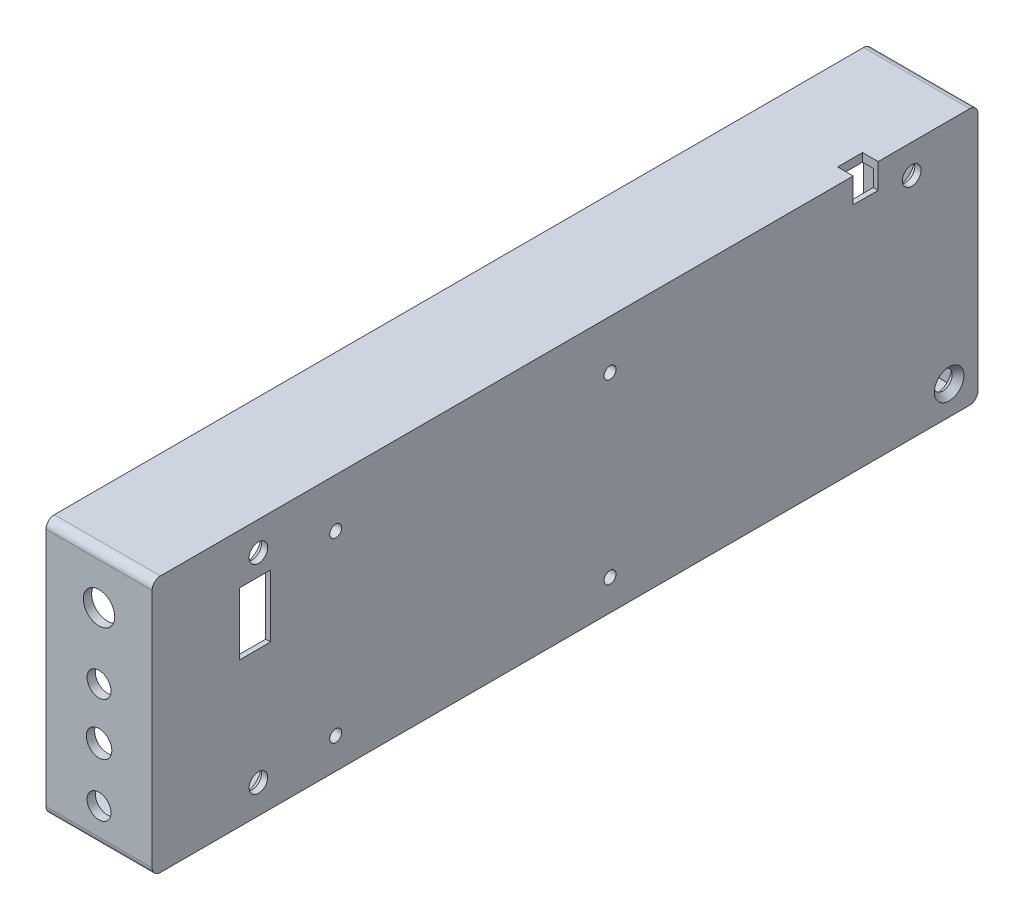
ISO-10303-21;
HEADER;
FILE_DESCRIPTION(('STEP AP214'),'2;1');
FILE_NAME('part.step','',(''),(''),'','','');
FILE_SCHEMA(('AUTOMOTIVE_DESIGN { 1 0 10303 214 1 1 1 1 }'));
ENDSEC;
DATA;
#1=APPLICATION_CONTEXT('core data for automotive mechanical design processes');
#2=APPLICATION_PROTOCOL_DEFINITION('international standard','automotive_design',2000,#1);
#3=PRODUCT_CONTEXT('',#1,'mechanical');
#4=PRODUCT('Part','Part','',(#3));
#5=PRODUCT_RELATED_PRODUCT_CATEGORY('part','',(#4));
#6=PRODUCT_DEFINITION_FORMATION('','',#4);
#7=PRODUCT_DEFINITION_CONTEXT('part definition',#1,'design');
#8=PRODUCT_DEFINITION('design','',#6,#7);
#9=PRODUCT_DEFINITION_SHAPE('','',#8);
#10=(LENGTH_UNIT() NAMED_UNIT(*) SI_UNIT(.MILLI.,.METRE.));
#11=(NAMED_UNIT(*) PLANE_ANGLE_UNIT() SI_UNIT($,.RADIAN.));
#12=(NAMED_UNIT(*) SI_UNIT($,.STERADIAN.) SOLID_ANGLE_UNIT());
#13=UNCERTAINTY_MEASURE_WITH_UNIT(LENGTH_MEASURE(1.E-05),#10,'distance_accuracy_value','');
#14=(GEOMETRIC_REPRESENTATION_CONTEXT(3) GLOBAL_UNCERTAINTY_ASSIGNED_CONTEXT((#13)) GLOBAL_UNIT_ASSIGNED_CONTEXT((#10,
#11,#12)) REPRESENTATION_CONTEXT('',''));
#15=CARTESIAN_POINT('',(0.,0.,0.));
#16=DIRECTION('',(0.,0.,1.));
#17=DIRECTION('',(1.,0.,0.));
#18=AXIS2_PLACEMENT_3D('',#15,#16,#17);
#19=CARTESIAN_POINT('',(8.50840804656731,-25.19,91.415463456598));
#20=DIRECTION('',(-0.5,0.866025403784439,0.));
#21=DIRECTION('',(-0.866025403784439,-0.5,0.));
#22=AXIS2_PLACEMENT_3D('',#19,#20,#21);
#23=PLANE('',#22);
#24=DIRECTION('',(-0.866025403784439,-0.5,0.));
#25=VECTOR('',#24,1.);
#26=CARTESIAN_POINT('',(8.50840804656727,-25.19,80.2513000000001));
#27=LINE('',#26,#25);
#28=CARTESIAN_POINT('',(9.80744615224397,-24.44,80.2513000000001));
#29=VERTEX_POINT('',#28);
#30=CARTESIAN_POINT('',(8.50840804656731,-25.19,80.2513000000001));
#31=VERTEX_POINT('',#30);
#32=EDGE_CURVE('E2257',#29,#31,#27,.T.);
#33=ORIENTED_EDGE('',*,*,#32,.F.);
#34=DIRECTION('',(0.,0.,-1.));
#35=VECTOR('',#34,1.);
#36=CARTESIAN_POINT('',(9.80744615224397,-24.44,91.415463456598));
#37=LINE('',#36,#35);
#38=CARTESIAN_POINT('',(9.80744615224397,-24.44,43.815));
#39=VERTEX_POINT('',#38);
#40=EDGE_CURVE('E669',#29,#39,#37,.T.);
#41=ORIENTED_EDGE('',*,*,#40,.T.);
#42=DIRECTION('',(0.866025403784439,0.5,0.));
#43=VECTOR('',#42,1.);
#44=CARTESIAN_POINT('',(8.50840804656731,-25.19,43.815));
#45=LINE('',#44,#43);
#46=CARTESIAN_POINT('',(8.50840804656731,-25.19,43.815));
#47=VERTEX_POINT('',#46);
#48=EDGE_CURVE('E524',#47,#39,#45,.T.);
#49=ORIENTED_EDGE('',*,*,#48,.F.);
#50=DIRECTION('',(0.,0.,-1.));
#51=VECTOR('',#50,1.);
#52=CARTESIAN_POINT('',(8.50840804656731,-25.19,91.415463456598));
#53=LINE('',#52,#51);
#54=EDGE_CURVE('E506',#31,#47,#53,.T.);
#55=ORIENTED_EDGE('',*,*,#54,.F.);
#56=EDGE_LOOP('',(#33,#41,#49,#55));
#57=FACE_BOUND('',#56,.T.);
#58=ADVANCED_FACE('F63',(#57),#23,.T.);
#59=CARTESIAN_POINT('',(7.20936994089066,-24.44,91.415463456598));
#60=DIRECTION('',(0.500000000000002,0.866025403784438,0.));
#61=DIRECTION('',(-0.866025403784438,0.500000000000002,0.));
#62=AXIS2_PLACEMENT_3D('',#59,#60,#61);
#63=PLANE('',#62);
#64=DIRECTION('',(-0.866025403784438,0.500000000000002,0.));
#65=VECTOR('',#64,1.);
#66=CARTESIAN_POINT('',(7.2093699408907,-24.44,80.2513000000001));
#67=LINE('',#66,#65);
#68=CARTESIAN_POINT('',(7.20936994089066,-24.44,80.2513000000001));
#69=VERTEX_POINT('',#68);
#70=EDGE_CURVE('E2258',#31,#69,#67,.T.);
#71=ORIENTED_EDGE('',*,*,#70,.F.);
#72=ORIENTED_EDGE('',*,*,#54,.T.);
#73=DIRECTION('',(0.866025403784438,-0.500000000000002,0.));
#74=VECTOR('',#73,1.);
#75=CARTESIAN_POINT('',(7.20936994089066,-24.44,43.815));
#76=LINE('',#75,#74);
#77=CARTESIAN_POINT('',(7.20936994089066,-24.44,43.815));
#78=VERTEX_POINT('',#77);
#79=EDGE_CURVE('E514',#78,#47,#76,.T.);
#80=ORIENTED_EDGE('',*,*,#79,.F.);
#81=DIRECTION('',(0.,0.,-1.));
#82=VECTOR('',#81,1.);
#83=CARTESIAN_POINT('',(7.20936994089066,-24.44,91.415463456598));
#84=LINE('',#83,#82);
#85=EDGE_CURVE('E505',#69,#78,#84,.T.);
#86=ORIENTED_EDGE('',*,*,#85,.F.);
#87=EDGE_LOOP('',(#71,#72,#80,#86));
#88=FACE_BOUND('',#87,.T.);
#89=ADVANCED_FACE('F1157',(#88),#63,.T.);
#90=CARTESIAN_POINT('',(8.50840804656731,25.19,91.415463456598));
#91=DIRECTION('',(0.5,0.866025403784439,0.));
#92=DIRECTION('',(-0.866025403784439,0.5,0.));
#93=AXIS2_PLACEMENT_3D('',#90,#91,#92);
#94=PLANE('',#93);
#95=DIRECTION('',(0.,0.,-1.));
#96=VECTOR('',#95,1.);
#97=CARTESIAN_POINT('',(9.80744615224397,24.44,91.415463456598));
#98=LINE('',#97,#96);
#99=CARTESIAN_POINT('',(9.80744615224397,24.44,80.2513000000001));
#100=VERTEX_POINT('',#99);
#101=CARTESIAN_POINT('',(9.80744615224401,24.44,43.8149999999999));
#102=VERTEX_POINT('',#101);
#103=EDGE_CURVE('E644',#100,#102,#98,.T.);
#104=ORIENTED_EDGE('',*,*,#103,.F.);
#105=DIRECTION('',(-0.866025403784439,0.5,0.));
#106=VECTOR('',#105,1.);
#107=CARTESIAN_POINT('',(8.50840804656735,25.19,80.2513000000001));
#108=LINE('',#107,#106);
#109=CARTESIAN_POINT('',(8.50840804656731,25.19,80.2513000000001));
#110=VERTEX_POINT('',#109);
#111=EDGE_CURVE('E527',#100,#110,#108,.T.);
#112=ORIENTED_EDGE('',*,*,#111,.T.);
#113=DIRECTION('',(0.,0.,-1.));
#114=VECTOR('',#113,1.);
#115=CARTESIAN_POINT('',(8.50840804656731,25.19,91.415463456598));
#116=LINE('',#115,#114);
#117=CARTESIAN_POINT('',(8.50840804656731,25.19,43.8149999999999));
#118=VERTEX_POINT('',#117);
#119=EDGE_CURVE('E641',#110,#118,#116,.T.);
#120=ORIENTED_EDGE('',*,*,#119,.T.);
#121=DIRECTION('',(0.866025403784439,-0.5,0.));
#122=VECTOR('',#121,1.);
#123=CARTESIAN_POINT('',(8.50840804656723,25.1900000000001,43.8149999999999));
#124=LINE('',#123,#122);
#125=EDGE_CURVE('E542',#118,#102,#124,.T.);
#126=ORIENTED_EDGE('',*,*,#125,.T.);
#127=EDGE_LOOP('',(#104,#112,#120,#126));
#128=FACE_BOUND('',#127,.T.);
#129=ADVANCED_FACE('F1164',(#128),#94,.F.);
#130=CARTESIAN_POINT('',(7.20936994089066,24.44,91.415463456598));
#131=DIRECTION('',(-0.500000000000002,0.866025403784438,0.));
#132=DIRECTION('',(-0.866025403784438,-0.500000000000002,0.));
#133=AXIS2_PLACEMENT_3D('',#130,#131,#132);
#134=PLANE('',#133);
#135=ORIENTED_EDGE('',*,*,#119,.F.);
#136=DIRECTION('',(-0.866025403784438,-0.500000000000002,0.));
#137=VECTOR('',#136,1.);
#138=CARTESIAN_POINT('',(7.20936994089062,24.44,80.2513000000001));
#139=LINE('',#138,#137);
#140=CARTESIAN_POINT('',(7.20936994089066,24.44,80.2513000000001));
#141=VERTEX_POINT('',#140);
#142=EDGE_CURVE('E2266',#110,#141,#139,.T.);
#143=ORIENTED_EDGE('',*,*,#142,.T.);
#144=DIRECTION('',(0.,0.,-1.));
#145=VECTOR('',#144,1.);
#146=CARTESIAN_POINT('',(7.20936994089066,24.44,91.415463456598));
#147=LINE('',#146,#145);
#148=CARTESIAN_POINT('',(7.20936994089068,24.44,43.8149999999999));
#149=VERTEX_POINT('',#148);
#150=EDGE_CURVE('E638',#141,#149,#147,.T.);
#151=ORIENTED_EDGE('',*,*,#150,.T.);
#152=DIRECTION('',(0.866025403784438,0.500000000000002,0.));
#153=VECTOR('',#152,1.);
#154=CARTESIAN_POINT('',(7.20936994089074,24.4400000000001,43.8149999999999));
#155=LINE('',#154,#153);
#156=EDGE_CURVE('E515',#149,#118,#155,.T.);
#157=ORIENTED_EDGE('',*,*,#156,.T.);
#158=EDGE_LOOP('',(#135,#143,#151,#157));
#159=FACE_BOUND('',#158,.T.);
#160=ADVANCED_FACE('F1348',(#159),#134,.F.);
#161=CARTESIAN_POINT('',(21.59,24.44,90.4113000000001));
#162=DIRECTION('',(0.,-1.,0.));
#163=DIRECTION('',(0.,0.,-1.));
#164=AXIS2_PLACEMENT_3D('',#161,#162,#163);
#165=PLANE('',#164);
#166=DIRECTION('',(-1.,0.,0.));
#167=VECTOR('',#166,1.);
#168=CARTESIAN_POINT('',(500000.,24.44,-9.97130000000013));
#169=LINE('',#168,#167);
#170=CARTESIAN_POINT('',(20.5900000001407,24.44,-9.97130000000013));
#171=VERTEX_POINT('',#170);
#172=CARTESIAN_POINT('',(9.80744615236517,24.44,-9.97130000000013));
#173=VERTEX_POINT('',#172);
#174=EDGE_CURVE('E863',#171,#173,#169,.T.);
#175=ORIENTED_EDGE('',*,*,#174,.T.);
#176=DIRECTION('',(0.,0.,1.));
#177=VECTOR('',#176,1.);
#178=CARTESIAN_POINT('',(9.80744615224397,24.44,-76.0113000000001));
#179=LINE('',#178,#177);
#180=CARTESIAN_POINT('',(9.80744615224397,24.44,-76.0113000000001));
#181=VERTEX_POINT('',#180);
#182=EDGE_CURVE('E615',#181,#173,#179,.T.);
#183=ORIENTED_EDGE('',*,*,#182,.F.);
#184=DIRECTION('',(-1.,0.,0.));
#185=VECTOR('',#184,1.);
#186=CARTESIAN_POINT('',(21.59,24.44,-76.0113000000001));
#187=LINE('',#186,#185);
#188=CARTESIAN_POINT('',(20.59,24.44,-76.0113000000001));
#189=VERTEX_POINT('',#188);
#190=EDGE_CURVE('E906',#189,#181,#187,.T.);
#191=ORIENTED_EDGE('',*,*,#190,.F.);
#192=DIRECTION('',(0.,0.,1.));
#193=VECTOR('',#192,1.);
#194=CARTESIAN_POINT('',(20.59,24.44,88.7113000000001));
#195=LINE('',#194,#193);
#196=CARTESIAN_POINT('',(20.5900000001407,24.44,-68.3913000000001));
#197=VERTEX_POINT('',#196);
#198=EDGE_CURVE('E884',#189,#197,#195,.T.);
#199=ORIENTED_EDGE('',*,*,#198,.T.);
#200=DIRECTION('',(1.,0.,0.));
#201=VECTOR('',#200,1.);
#202=CARTESIAN_POINT('',(19.05,24.44,-68.3913000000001));
#203=LINE('',#202,#201);
#204=CARTESIAN_POINT('',(19.05,24.44,-68.3913000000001));
#205=VERTEX_POINT('',#204);
#206=EDGE_CURVE('E721',#205,#197,#203,.T.);
#207=ORIENTED_EDGE('',*,*,#206,.F.);
#208=DIRECTION('',(0.,0.,1.));
#209=VECTOR('',#208,1.);
#210=CARTESIAN_POINT('',(19.05,24.44,-60.0413000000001));
#211=LINE('',#210,#209);
#212=CARTESIAN_POINT('',(19.05,24.44,-60.0413000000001));
#213=VERTEX_POINT('',#212);
#214=EDGE_CURVE('E718',#205,#213,#211,.T.);
#215=ORIENTED_EDGE('',*,*,#214,.T.);
#216=DIRECTION('',(1.,0.,0.));
#217=VECTOR('',#216,1.);
#218=CARTESIAN_POINT('',(19.05,24.44,-60.0413000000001));
#219=LINE('',#218,#217);
#220=CARTESIAN_POINT('',(20.5900000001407,24.44,-60.0413000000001));
#221=VERTEX_POINT('',#220);
#222=EDGE_CURVE('E722',#213,#221,#219,.T.);
#223=ORIENTED_EDGE('',*,*,#222,.T.);
#224=CARTESIAN_POINT('',(20.5900000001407,24.44,-57.3913000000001));
#225=VERTEX_POINT('',#224);
#226=EDGE_CURVE('E888',#221,#225,#195,.T.);
#227=ORIENTED_EDGE('',*,*,#226,.T.);
#228=DIRECTION('',(1.,0.,0.));
#229=VECTOR('',#228,1.);
#230=CARTESIAN_POINT('',(21.59,24.44,-57.3913000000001));
#231=LINE('',#230,#229);
#232=CARTESIAN_POINT('',(18.415,24.44,-57.3913000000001));
#233=VERTEX_POINT('',#232);
#234=EDGE_CURVE('E809',#233,#225,#231,.T.);
#235=ORIENTED_EDGE('',*,*,#234,.F.);
#236=DIRECTION('',(0.,0.,-1.));
#237=VECTOR('',#236,1.);
#238=CARTESIAN_POINT('',(18.415,24.44,90.4113000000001));
#239=LINE('',#238,#237);
#240=CARTESIAN_POINT('',(18.415,24.44,-52.3113000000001));
#241=VERTEX_POINT('',#240);
#242=EDGE_CURVE('E821',#241,#233,#239,.T.);
#243=ORIENTED_EDGE('',*,*,#242,.F.);
#244=DIRECTION('',(-1.,0.,0.));
#245=VECTOR('',#244,1.);
#246=CARTESIAN_POINT('',(21.59,24.44,-52.3113000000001));
#247=LINE('',#246,#245);
#248=CARTESIAN_POINT('',(20.5900000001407,24.44,-52.3113000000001));
#249=VERTEX_POINT('',#248);
#250=EDGE_CURVE('E824',#249,#241,#247,.T.);
#251=ORIENTED_EDGE('',*,*,#250,.F.);
#252=EDGE_CURVE('E1436',#249,#171,#195,.T.);
#253=ORIENTED_EDGE('',*,*,#252,.T.);
#254=EDGE_LOOP('',(#175,#183,#191,#199,#207,#215,#223,#227,#235,#243,#251,#253));
#255=FACE_BOUND('',#254,.T.);
#256=ADVANCED_FACE('F1344',(#255),#165,.T.);
#257=DIRECTION('',(-1.,0.,0.));
#258=VECTOR('',#257,1.);
#259=CARTESIAN_POINT('',(30.8912426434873,24.44,80.2513000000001));
#260=LINE('',#259,#258);
#261=EDGE_CURVE('E2264',#100,#141,#260,.T.);
#262=ORIENTED_EDGE('',*,*,#261,.F.);
#263=ORIENTED_EDGE('',*,*,#103,.T.);
#264=DIRECTION('',(-1.,0.,0.));
#265=VECTOR('',#264,1.);
#266=CARTESIAN_POINT('',(30.8912426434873,24.44,43.8149999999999));
#267=LINE('',#266,#265);
#268=EDGE_CURVE('E534',#102,#149,#267,.T.);
#269=ORIENTED_EDGE('',*,*,#268,.T.);
#270=ORIENTED_EDGE('',*,*,#150,.F.);
#271=EDGE_LOOP('',(#262,#263,#269,#270));
#272=FACE_BOUND('',#271,.T.);
#273=DIRECTION('',(-1.,0.,0.));
#274=VECTOR('',#273,1.);
#275=CARTESIAN_POINT('',(21.59,24.44,88.7113000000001));
#276=LINE('',#275,#274);
#277=CARTESIAN_POINT('',(20.59,24.44,88.7113000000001));
#278=VERTEX_POINT('',#277);
#279=CARTESIAN_POINT('',(0.,24.44,88.7113000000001));
#280=VERTEX_POINT('',#279);
#281=EDGE_CURVE('E902',#278,#280,#276,.T.);
#282=ORIENTED_EDGE('',*,*,#281,.T.);
#283=DIRECTION('',(0.,0.,1.));
#284=VECTOR('',#283,1.);
#285=CARTESIAN_POINT('',(0.,24.44,90.4113000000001));
#286=LINE('',#285,#284);
#287=CARTESIAN_POINT('',(0.,24.44,-76.0113000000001));
#288=VERTEX_POINT('',#287);
#289=EDGE_CURVE('E899',#288,#280,#286,.T.);
#290=ORIENTED_EDGE('',*,*,#289,.F.);
#291=CARTESIAN_POINT('',(7.20936994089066,24.44,-76.0113000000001));
#292=VERTEX_POINT('',#291);
#293=EDGE_CURVE('E905',#292,#288,#187,.T.);
#294=ORIENTED_EDGE('',*,*,#293,.F.);
#295=DIRECTION('',(0.,0.,1.));
#296=VECTOR('',#295,1.);
#297=CARTESIAN_POINT('',(7.20936994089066,24.44,-76.0113000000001));
#298=LINE('',#297,#296);
#299=CARTESIAN_POINT('',(7.20936994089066,24.44,-9.97130000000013));
#300=VERTEX_POINT('',#299);
#301=EDGE_CURVE('E621',#292,#300,#298,.T.);
#302=ORIENTED_EDGE('',*,*,#301,.T.);
#303=DIRECTION('',(-1.,0.,0.));
#304=VECTOR('',#303,1.);
#305=CARTESIAN_POINT('',(9.80744615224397,24.44,-9.97130000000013));
#306=LINE('',#305,#304);
#307=CARTESIAN_POINT('',(9.5250000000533,24.44,-9.97130000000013));
#308=VERTEX_POINT('',#307);
#309=EDGE_CURVE('E609',#308,#300,#306,.T.);
#310=ORIENTED_EDGE('',*,*,#309,.F.);
#311=DIRECTION('',(0.,0.,1.));
#312=VECTOR('',#311,1.);
#313=CARTESIAN_POINT('',(9.525,24.44,-77.7123000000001));
#314=LINE('',#313,#312);
#315=CARTESIAN_POINT('',(9.52500000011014,24.44,-7.43130000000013));
#316=VERTEX_POINT('',#315);
#317=EDGE_CURVE('E843',#308,#316,#314,.T.);
#318=ORIENTED_EDGE('',*,*,#317,.T.);
#319=DIRECTION('',(-1.,0.,0.));
#320=VECTOR('',#319,1.);
#321=CARTESIAN_POINT('',(9.80744615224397,24.44,-7.43130000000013));
#322=LINE('',#321,#320);
#323=CARTESIAN_POINT('',(7.20936994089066,24.44,-7.43130000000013));
#324=VERTEX_POINT('',#323);
#325=EDGE_CURVE('E624',#316,#324,#322,.T.);
#326=ORIENTED_EDGE('',*,*,#325,.T.);
#327=CARTESIAN_POINT('',(7.20936994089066,24.44,37.465));
#328=VERTEX_POINT('',#327);
#329=EDGE_CURVE('E637',#328,#324,#147,.T.);
#330=ORIENTED_EDGE('',*,*,#329,.F.);
#331=DIRECTION('',(-1.,0.,0.));
#332=VECTOR('',#331,1.);
#333=CARTESIAN_POINT('',(30.8912426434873,24.44,37.465));
#334=LINE('',#333,#332);
#335=CARTESIAN_POINT('',(9.807446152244,24.44,37.465));
#336=VERTEX_POINT('',#335);
#337=EDGE_CURVE('E537',#336,#328,#334,.T.);
#338=ORIENTED_EDGE('',*,*,#337,.F.);
#339=CARTESIAN_POINT('',(9.80744615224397,24.44,-7.43130000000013));
#340=VERTEX_POINT('',#339);
#341=EDGE_CURVE('E643',#336,#340,#98,.T.);
#342=ORIENTED_EDGE('',*,*,#341,.T.);
#343=DIRECTION('',(-1.,0.,0.));
#344=VECTOR('',#343,1.);
#345=CARTESIAN_POINT('',(500000.,24.44,-7.43130000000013));
#346=LINE('',#345,#344);
#347=CARTESIAN_POINT('',(20.5900000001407,24.44,-7.43130000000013));
#348=VERTEX_POINT('',#347);
#349=EDGE_CURVE('E852',#348,#340,#346,.T.);
#350=ORIENTED_EDGE('',*,*,#349,.F.);
#351=CARTESIAN_POINT('',(20.59,24.44,64.5879));
#352=VERTEX_POINT('',#351);
#353=EDGE_CURVE('E889',#348,#352,#195,.T.);
#354=ORIENTED_EDGE('',*,*,#353,.T.);
#355=DIRECTION('',(1.,0.,0.));
#356=VECTOR('',#355,1.);
#357=CARTESIAN_POINT('',(19.05,24.44,64.5879));
#358=LINE('',#357,#356);
#359=CARTESIAN_POINT('',(19.05,24.44,64.5879));
#360=VERTEX_POINT('',#359);
#361=EDGE_CURVE('E783',#360,#352,#358,.T.);
#362=ORIENTED_EDGE('',*,*,#361,.F.);
#363=DIRECTION('',(0.,0.,1.));
#364=VECTOR('',#363,1.);
#365=CARTESIAN_POINT('',(19.05,24.44,64.5879));
#366=LINE('',#365,#364);
#367=CARTESIAN_POINT('',(19.05,24.44,72.9379000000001));
#368=VERTEX_POINT('',#367);
#369=EDGE_CURVE('E774',#360,#368,#366,.T.);
#370=ORIENTED_EDGE('',*,*,#369,.T.);
#371=DIRECTION('',(1.,0.,0.));
#372=VECTOR('',#371,1.);
#373=CARTESIAN_POINT('',(19.05,24.44,72.9379000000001));
#374=LINE('',#373,#372);
#375=CARTESIAN_POINT('',(20.59,24.44,72.9379000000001));
#376=VERTEX_POINT('',#375);
#377=EDGE_CURVE('E784',#368,#376,#374,.T.);
#378=ORIENTED_EDGE('',*,*,#377,.T.);
#379=EDGE_CURVE('E883',#376,#278,#195,.T.);
#380=ORIENTED_EDGE('',*,*,#379,.T.);
#381=EDGE_LOOP('',(#282,#290,#294,#302,#310,#318,#326,#330,#338,#342,#350,#354,#362,#370,#378,#380));
#382=FACE_BOUND('',#381,.T.);
#383=ADVANCED_FACE('F1347',(#272,#382),#165,.T.);
#384=CARTESIAN_POINT('',(21.59,-24.44,90.4113000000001));
#385=DIRECTION('',(0.,1.,0.));
#386=DIRECTION('',(0.,0.,1.));
#387=AXIS2_PLACEMENT_3D('',#384,#385,#386);
#388=PLANE('',#387);
#389=DIRECTION('',(0.,0.,1.));
#390=VECTOR('',#389,1.);
#391=CARTESIAN_POINT('',(9.80744615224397,-24.44,-76.0113000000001));
#392=LINE('',#391,#390);
#393=CARTESIAN_POINT('',(9.80744615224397,-24.44,-76.0113000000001));
#394=VERTEX_POINT('',#393);
#395=CARTESIAN_POINT('',(9.80744615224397,-24.44,-9.97130000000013));
#396=VERTEX_POINT('',#395);
#397=EDGE_CURVE('E658',#394,#396,#392,.T.);
#398=ORIENTED_EDGE('',*,*,#397,.T.);
#399=DIRECTION('',(-1.,0.,0.));
#400=VECTOR('',#399,1.);
#401=CARTESIAN_POINT('',(500000.,-24.44,-9.97130000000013));
#402=LINE('',#401,#400);
#403=CARTESIAN_POINT('',(20.5900000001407,-24.44,-9.97130000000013));
#404=VERTEX_POINT('',#403);
#405=EDGE_CURVE('E867',#404,#396,#402,.T.);
#406=ORIENTED_EDGE('',*,*,#405,.F.);
#407=DIRECTION('',(0.,0.,-1.));
#408=VECTOR('',#407,1.);
#409=CARTESIAN_POINT('',(20.59,-24.44,88.7113000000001));
#410=LINE('',#409,#408);
#411=CARTESIAN_POINT('',(20.59,-24.44,-67.6613000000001));
#412=VERTEX_POINT('',#411);
#413=EDGE_CURVE('E877',#404,#412,#410,.T.);
#414=ORIENTED_EDGE('',*,*,#413,.T.);
#415=DIRECTION('',(1.,0.,0.));
#416=VECTOR('',#415,1.);
#417=CARTESIAN_POINT('',(19.05,-24.44,-67.6613000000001));
#418=LINE('',#417,#416);
#419=CARTESIAN_POINT('',(19.05,-24.44,-67.6613000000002));
#420=VERTEX_POINT('',#419);
#421=EDGE_CURVE('E746',#420,#412,#418,.T.);
#422=ORIENTED_EDGE('',*,*,#421,.F.);
#423=DIRECTION('',(0.,0.,-1.));
#424=VECTOR('',#423,1.);
#425=CARTESIAN_POINT('',(19.05,-24.44,-76.0113000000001));
#426=LINE('',#425,#424);
#427=CARTESIAN_POINT('',(19.05,-24.44,-76.0113000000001));
#428=VERTEX_POINT('',#427);
#429=EDGE_CURVE('E742',#420,#428,#426,.T.);
#430=ORIENTED_EDGE('',*,*,#429,.T.);
#431=DIRECTION('',(-1.,0.,0.));
#432=VECTOR('',#431,1.);
#433=CARTESIAN_POINT('',(21.59,-24.44,-76.0113000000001));
#434=LINE('',#433,#432);
#435=EDGE_CURVE('E910',#428,#394,#434,.T.);
#436=ORIENTED_EDGE('',*,*,#435,.T.);
#437=EDGE_LOOP('',(#398,#406,#414,#422,#430,#436));
#438=FACE_BOUND('',#437,.T.);
#439=ADVANCED_FACE('F1354',(#438),#388,.T.);
#440=ORIENTED_EDGE('',*,*,#40,.F.);
#441=DIRECTION('',(-1.,0.,0.));
#442=VECTOR('',#441,1.);
#443=CARTESIAN_POINT('',(30.8912426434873,-24.44,80.2513000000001));
#444=LINE('',#443,#442);
#445=EDGE_CURVE('E2256',#29,#69,#444,.T.);
#446=ORIENTED_EDGE('',*,*,#445,.T.);
#447=ORIENTED_EDGE('',*,*,#85,.T.);
#448=DIRECTION('',(-1.,0.,0.));
#449=VECTOR('',#448,1.);
#450=CARTESIAN_POINT('',(30.8912426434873,-24.44,43.815));
#451=LINE('',#450,#449);
#452=EDGE_CURVE('E522',#39,#78,#451,.T.);
#453=ORIENTED_EDGE('',*,*,#452,.F.);
#454=EDGE_LOOP('',(#440,#446,#447,#453));
#455=FACE_BOUND('',#454,.T.);
#456=DIRECTION('',(0.,0.,-1.));
#457=VECTOR('',#456,1.);
#458=CARTESIAN_POINT('',(0.,-24.44,90.4113000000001));
#459=LINE('',#458,#457);
#460=CARTESIAN_POINT('',(0.,-24.44,88.7113000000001));
#461=VERTEX_POINT('',#460);
#462=CARTESIAN_POINT('',(0.,-24.44,-7.43130000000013));
#463=VERTEX_POINT('',#462);
#464=EDGE_CURVE('E894',#461,#463,#459,.T.);
#465=ORIENTED_EDGE('',*,*,#464,.F.);
#466=DIRECTION('',(-1.,0.,0.));
#467=VECTOR('',#466,1.);
#468=CARTESIAN_POINT('',(21.59,-24.44,88.7113000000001));
#469=LINE('',#468,#467);
#470=CARTESIAN_POINT('',(20.59,-24.44,88.7113000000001));
#471=VERTEX_POINT('',#470);
#472=EDGE_CURVE('E913',#471,#461,#469,.T.);
#473=ORIENTED_EDGE('',*,*,#472,.F.);
#474=CARTESIAN_POINT('',(20.59,-24.44,72.9379000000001));
#475=VERTEX_POINT('',#474);
#476=EDGE_CURVE('E878',#471,#475,#410,.T.);
#477=ORIENTED_EDGE('',*,*,#476,.T.);
#478=DIRECTION('',(1.,0.,0.));
#479=VECTOR('',#478,1.);
#480=CARTESIAN_POINT('',(19.05,-24.44,72.9379000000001));
#481=LINE('',#480,#479);
#482=CARTESIAN_POINT('',(19.05,-24.44,72.9379000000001));
#483=VERTEX_POINT('',#482);
#484=EDGE_CURVE('E766',#483,#475,#481,.T.);
#485=ORIENTED_EDGE('',*,*,#484,.F.);
#486=DIRECTION('',(0.,0.,-1.));
#487=VECTOR('',#486,1.);
#488=CARTESIAN_POINT('',(19.05,-24.44,72.9379000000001));
#489=LINE('',#488,#487);
#490=CARTESIAN_POINT('',(19.05,-24.44,64.5879000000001));
#491=VERTEX_POINT('',#490);
#492=EDGE_CURVE('E757',#483,#491,#489,.T.);
#493=ORIENTED_EDGE('',*,*,#492,.T.);
#494=DIRECTION('',(1.,0.,0.));
#495=VECTOR('',#494,1.);
#496=CARTESIAN_POINT('',(19.05,-24.44,64.5879000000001));
#497=LINE('',#496,#495);
#498=CARTESIAN_POINT('',(20.59,-24.44,64.5879000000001));
#499=VERTEX_POINT('',#498);
#500=EDGE_CURVE('E767',#491,#499,#497,.T.);
#501=ORIENTED_EDGE('',*,*,#500,.T.);
#502=CARTESIAN_POINT('',(20.59,-24.44,-7.43130000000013));
#503=VERTEX_POINT('',#502);
#504=EDGE_CURVE('E881',#499,#503,#410,.T.);
#505=ORIENTED_EDGE('',*,*,#504,.T.);
#506=DIRECTION('',(-1.,0.,0.));
#507=VECTOR('',#506,1.);
#508=CARTESIAN_POINT('',(500000.,-24.44,-7.43130000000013));
#509=LINE('',#508,#507);
#510=CARTESIAN_POINT('',(9.80744615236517,-24.44,-7.43130000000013));
#511=VERTEX_POINT('',#510);
#512=EDGE_CURVE('E860',#503,#511,#509,.T.);
#513=ORIENTED_EDGE('',*,*,#512,.T.);
#514=CARTESIAN_POINT('',(9.80744615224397,-24.44,37.465));
#515=VERTEX_POINT('',#514);
#516=EDGE_CURVE('E521',#515,#511,#37,.T.);
#517=ORIENTED_EDGE('',*,*,#516,.F.);
#518=DIRECTION('',(-1.,0.,0.));
#519=VECTOR('',#518,1.);
#520=CARTESIAN_POINT('',(30.8912426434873,-24.44,37.465));
#521=LINE('',#520,#519);
#522=CARTESIAN_POINT('',(7.20936994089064,-24.44,37.465));
#523=VERTEX_POINT('',#522);
#524=EDGE_CURVE('E512',#515,#523,#521,.T.);
#525=ORIENTED_EDGE('',*,*,#524,.T.);
#526=CARTESIAN_POINT('',(7.20936994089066,-24.44,-7.43130000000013));
#527=VERTEX_POINT('',#526);
#528=EDGE_CURVE('E494',#523,#527,#84,.T.);
#529=ORIENTED_EDGE('',*,*,#528,.T.);
#530=EDGE_CURVE('E870',#527,#463,#509,.T.);
#531=ORIENTED_EDGE('',*,*,#530,.T.);
#532=EDGE_LOOP('',(#465,#473,#477,#485,#493,#501,#505,#513,#517,#525,#529,#531));
#533=FACE_BOUND('',#532,.T.);
#534=ADVANCED_FACE('F519',(#455,#533),#388,.T.);
#535=DIRECTION('',(0.,0.,1.));
#536=VECTOR('',#535,1.);
#537=CARTESIAN_POINT('',(7.20936994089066,-24.44,-76.0113000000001));
#538=LINE('',#537,#536);
#539=CARTESIAN_POINT('',(7.20936994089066,-24.44,-76.0113000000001));
#540=VERTEX_POINT('',#539);
#541=CARTESIAN_POINT('',(7.20936994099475,-24.44,-9.97130000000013));
#542=VERTEX_POINT('',#541);
#543=EDGE_CURVE('E654',#540,#542,#538,.T.);
#544=ORIENTED_EDGE('',*,*,#543,.F.);
#545=CARTESIAN_POINT('',(0.,-24.44,-76.0113000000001));
#546=VERTEX_POINT('',#545);
#547=EDGE_CURVE('E909',#540,#546,#434,.T.);
#548=ORIENTED_EDGE('',*,*,#547,.T.);
#549=CARTESIAN_POINT('',(0.,-24.44,-9.97130000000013));
#550=VERTEX_POINT('',#549);
#551=EDGE_CURVE('E893',#550,#546,#459,.T.);
#552=ORIENTED_EDGE('',*,*,#551,.F.);
#553=EDGE_CURVE('E866',#542,#550,#402,.T.);
#554=ORIENTED_EDGE('',*,*,#553,.F.);
#555=EDGE_LOOP('',(#544,#548,#552,#554));
#556=FACE_BOUND('',#555,.T.);
#557=ADVANCED_FACE('F1358',(#556),#388,.T.);
#558=CARTESIAN_POINT('',(20.59,0.,0.));
#559=DIRECTION('',(1.,0.,0.));
#560=DIRECTION('',(0.,0.,-1.));
#561=AXIS2_PLACEMENT_3D('',#558,#559,#560);
#562=PLANE('',#561);
#563=ORIENTED_EDGE('',*,*,#226,.F.);
#564=DIRECTION('',(0.,-1.,0.));
#565=VECTOR('',#564,1.);
#566=CARTESIAN_POINT('',(20.59,0.,-60.0413000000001));
#567=LINE('',#566,#565);
#568=CARTESIAN_POINT('',(20.59,19.9,-60.0413000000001));
#569=VERTEX_POINT('',#568);
#570=EDGE_CURVE('E732',#221,#569,#567,.T.);
#571=ORIENTED_EDGE('',*,*,#570,.T.);
#572=CARTESIAN_POINT('',(20.59,19.9,-63.8513000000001));
#573=DIRECTION('',(1.,0.,0.));
#574=DIRECTION('',(0.,0.,-1.));
#575=AXIS2_PLACEMENT_3D('',#572,#573,#574);
#576=CIRCLE('',#575,3.81);
#577=CARTESIAN_POINT('',(20.59,16.09,-63.8513000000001));
#578=VERTEX_POINT('',#577);
#579=EDGE_CURVE('E1007',#569,#578,#576,.T.);
#580=ORIENTED_EDGE('',*,*,#579,.T.);
#581=DIRECTION('',(0.,0.,-1.));
#582=VECTOR('',#581,1.);
#583=CARTESIAN_POINT('',(20.59,16.09,0.));
#584=LINE('',#583,#582);
#585=CARTESIAN_POINT('',(20.59,16.09,-64.5813000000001));
#586=VERTEX_POINT('',#585);
#587=EDGE_CURVE('E725',#578,#586,#584,.T.);
#588=ORIENTED_EDGE('',*,*,#587,.T.);
#589=CARTESIAN_POINT('',(20.59,19.9,-64.5813000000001));
#590=DIRECTION('',(1.,0.,0.));
#591=DIRECTION('',(0.,0.,-1.));
#592=AXIS2_PLACEMENT_3D('',#589,#590,#591);
#593=CIRCLE('',#592,3.81);
#594=CARTESIAN_POINT('',(20.59,19.9,-68.3913000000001));
#595=VERTEX_POINT('',#594);
#596=EDGE_CURVE('E1005',#586,#595,#593,.T.);
#597=ORIENTED_EDGE('',*,*,#596,.T.);
#598=DIRECTION('',(0.,1.,0.));
#599=VECTOR('',#598,1.);
#600=CARTESIAN_POINT('',(20.59,0.,-68.3913000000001));
#601=LINE('',#600,#599);
#602=EDGE_CURVE('E730',#595,#197,#601,.T.);
#603=ORIENTED_EDGE('',*,*,#602,.T.);
#604=ORIENTED_EDGE('',*,*,#198,.F.);
#605=DIRECTION('',(0.,1.,0.));
#606=VECTOR('',#605,1.);
#607=CARTESIAN_POINT('',(20.59,24.44,-76.0113000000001));
#608=LINE('',#607,#606);
#609=CARTESIAN_POINT('',(20.59,-16.09,-76.0113000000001));
#610=VERTEX_POINT('',#609);
#611=EDGE_CURVE('E880',#610,#189,#608,.T.);
#612=ORIENTED_EDGE('',*,*,#611,.F.);
#613=DIRECTION('',(0.,0.,1.));
#614=VECTOR('',#613,1.);
#615=CARTESIAN_POINT('',(20.59,-16.09,0.));
#616=LINE('',#615,#614);
#617=CARTESIAN_POINT('',(20.59,-16.09,-71.4713000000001));
#618=VERTEX_POINT('',#617);
#619=EDGE_CURVE('E749',#610,#618,#616,.T.);
#620=ORIENTED_EDGE('',*,*,#619,.T.);
#621=CARTESIAN_POINT('',(20.59,-19.9,-71.4713000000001));
#622=DIRECTION('',(1.,0.,0.));
#623=DIRECTION('',(0.,0.,-1.));
#624=AXIS2_PLACEMENT_3D('',#621,#622,#623);
#625=CIRCLE('',#624,3.81);
#626=CARTESIAN_POINT('',(20.59,-19.9,-67.6613000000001));
#627=VERTEX_POINT('',#626);
#628=EDGE_CURVE('E1009',#618,#627,#625,.T.);
#629=ORIENTED_EDGE('',*,*,#628,.T.);
#630=DIRECTION('',(0.,-1.,0.));
#631=VECTOR('',#630,1.);
#632=CARTESIAN_POINT('',(20.59,0.,-67.6613000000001));
#633=LINE('',#632,#631);
#634=EDGE_CURVE('E753',#627,#412,#633,.T.);
#635=ORIENTED_EDGE('',*,*,#634,.T.);
#636=ORIENTED_EDGE('',*,*,#413,.F.);
#637=DIRECTION('',(0.,1.,0.));
#638=VECTOR('',#637,1.);
#639=CARTESIAN_POINT('',(20.590000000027,-24.44,-9.97130000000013));
#640=LINE('',#639,#638);
#641=EDGE_CURVE('E849',#404,#171,#640,.T.);
#642=ORIENTED_EDGE('',*,*,#641,.T.);
#643=ORIENTED_EDGE('',*,*,#252,.F.);
#644=DIRECTION('',(0.,-1.,0.));
#645=VECTOR('',#644,1.);
#646=CARTESIAN_POINT('',(20.59,0.,-52.3113000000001));
#647=LINE('',#646,#645);
#648=CARTESIAN_POINT('',(20.59,21.06,-52.3113000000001));
#649=VERTEX_POINT('',#648);
#650=EDGE_CURVE('E826',#249,#649,#647,.T.);
#651=ORIENTED_EDGE('',*,*,#650,.T.);
#652=DIRECTION('',(0.,0.,1.));
#653=VECTOR('',#652,1.);
#654=CARTESIAN_POINT('',(20.59,21.06,0.));
#655=LINE('',#654,#653);
#656=CARTESIAN_POINT('',(20.59,21.06,-57.3913000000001));
#657=VERTEX_POINT('',#656);
#658=EDGE_CURVE('E829',#657,#649,#655,.T.);
#659=ORIENTED_EDGE('',*,*,#658,.F.);
#660=DIRECTION('',(0.,1.,0.));
#661=VECTOR('',#660,1.);
#662=CARTESIAN_POINT('',(20.59,0.,-57.3913000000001));
#663=LINE('',#662,#661);
#664=EDGE_CURVE('E818',#657,#225,#663,.T.);
#665=ORIENTED_EDGE('',*,*,#664,.T.);
#666=EDGE_LOOP('',(#563,#571,#580,#588,#597,#603,#604,#612,#620,#629,#635,#636,#642,#643,#651,
#659,#665));
#667=FACE_BOUND('',#666,.T.);
#668=ADVANCED_FACE('F1343',(#667),#562,.F.);
#669=CARTESIAN_POINT('',(21.59,26.14,88.7113000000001));
#670=DIRECTION('',(0.,0.,-1.));
#671=DIRECTION('',(-1.,0.,0.));
#672=AXIS2_PLACEMENT_3D('',#669,#670,#671);
#673=PLANE('',#672);
#674=ORIENTED_EDGE('',*,*,#472,.T.);
#675=DIRECTION('',(0.,-1.,0.));
#676=VECTOR('',#675,1.);
#677=CARTESIAN_POINT('',(0.,26.14,88.7113000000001));
#678=LINE('',#677,#676);
#679=EDGE_CURVE('E887',#280,#461,#678,.T.);
#680=ORIENTED_EDGE('',*,*,#679,.F.);
#681=ORIENTED_EDGE('',*,*,#281,.F.);
#682=DIRECTION('',(0.,-1.,0.));
#683=VECTOR('',#682,1.);
#684=CARTESIAN_POINT('',(20.59,24.44,88.7113000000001));
#685=LINE('',#684,#683);
#686=EDGE_CURVE('E856',#278,#471,#685,.T.);
#687=ORIENTED_EDGE('',*,*,#686,.T.);
#688=EDGE_LOOP('',(#674,#680,#681,#687));
#689=FACE_BOUND('',#688,.T.);
#690=CARTESIAN_POINT('',(10.795,-7.90519574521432,88.7113000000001));
#691=DIRECTION('',(0.,0.,-1.));
#692=DIRECTION('',(-1.,0.,0.));
#693=AXIS2_PLACEMENT_3D('',#690,#691,#692);
#694=CIRCLE('',#693,2.6);
#695=CARTESIAN_POINT('',(8.19500000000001,-7.90519574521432,88.7113000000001));
#696=VERTEX_POINT('',#695);
#697=EDGE_CURVE('E546',#696,#696,#694,.F.);
#698=ORIENTED_EDGE('',*,*,#697,.T.);
#699=EDGE_LOOP('',(#698));
#700=FACE_BOUND('',#699,.T.);
#701=CARTESIAN_POINT('',(10.795,2.51404478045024,88.7113000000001));
#702=DIRECTION('',(0.,0.,-1.));
#703=DIRECTION('',(-1.,0.,0.));
#704=AXIS2_PLACEMENT_3D('',#701,#702,#703);
#705=CIRCLE('',#704,2.4368);
#706=CARTESIAN_POINT('',(8.35820000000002,2.51404478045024,88.7113000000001));
#707=VERTEX_POINT('',#706);
#708=EDGE_CURVE('E554',#707,#707,#705,.F.);
#709=ORIENTED_EDGE('',*,*,#708,.T.);
#710=EDGE_LOOP('',(#709));
#711=FACE_BOUND('',#710,.T.);
#712=CARTESIAN_POINT('',(10.795,15.98,88.7113000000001));
#713=DIRECTION('',(0.,0.,-1.));
#714=DIRECTION('',(-1.,0.,0.));
#715=AXIS2_PLACEMENT_3D('',#712,#713,#714);
#716=CIRCLE('',#715,3.20515);
#717=CARTESIAN_POINT('',(7.58985000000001,15.98,88.7113000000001));
#718=VERTEX_POINT('',#717);
#719=EDGE_CURVE('E545',#718,#718,#716,.F.);
#720=ORIENTED_EDGE('',*,*,#719,.T.);
#721=EDGE_LOOP('',(#720));
#722=FACE_BOUND('',#721,.T.);
#723=CARTESIAN_POINT('',(10.795,-18.9699,88.7113000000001));
#724=DIRECTION('',(0.,0.,-1.));
#725=DIRECTION('',(-1.,0.,0.));
#726=AXIS2_PLACEMENT_3D('',#723,#724,#725);
#727=CIRCLE('',#726,2.4368);
#728=CARTESIAN_POINT('',(8.35820000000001,-18.9699,88.7113000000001));
#729=VERTEX_POINT('',#728);
#730=EDGE_CURVE('E553',#729,#729,#727,.F.);
#731=ORIENTED_EDGE('',*,*,#730,.T.);
#732=EDGE_LOOP('',(#731));
#733=FACE_BOUND('',#732,.T.);
#734=ADVANCED_FACE('F1190',(#689,#700,#711,#722,#733),#673,.T.);
#735=CARTESIAN_POINT('',(21.59,26.14,-76.0113000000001));
#736=DIRECTION('',(0.,0.,1.));
#737=DIRECTION('',(1.,0.,0.));
#738=AXIS2_PLACEMENT_3D('',#735,#736,#737);
#739=PLANE('',#738);
#740=DIRECTION('',(1.,0.,0.));
#741=VECTOR('',#740,1.);
#742=CARTESIAN_POINT('',(19.05,-16.09,-76.0113000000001));
#743=LINE('',#742,#741);
#744=CARTESIAN_POINT('',(19.05,-16.09,-76.0113000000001));
#745=VERTEX_POINT('',#744);
#746=EDGE_CURVE('E745',#745,#610,#743,.T.);
#747=ORIENTED_EDGE('',*,*,#746,.T.);
#748=ORIENTED_EDGE('',*,*,#611,.T.);
#749=ORIENTED_EDGE('',*,*,#190,.T.);
#750=DIRECTION('',(0.866025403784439,-0.5,0.));
#751=VECTOR('',#750,1.);
#752=CARTESIAN_POINT('',(8.50840804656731,25.19,-76.0113000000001));
#753=LINE('',#752,#751);
#754=CARTESIAN_POINT('',(8.50840804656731,25.19,-76.0113000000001));
#755=VERTEX_POINT('',#754);
#756=EDGE_CURVE('E610',#755,#181,#753,.T.);
#757=ORIENTED_EDGE('',*,*,#756,.F.);
#758=DIRECTION('',(0.866025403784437,0.500000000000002,0.));
#759=VECTOR('',#758,1.);
#760=CARTESIAN_POINT('',(7.20936994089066,24.44,-76.0113000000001));
#761=LINE('',#760,#759);
#762=EDGE_CURVE('E612',#292,#755,#761,.T.);
#763=ORIENTED_EDGE('',*,*,#762,.F.);
#764=ORIENTED_EDGE('',*,*,#293,.T.);
#765=DIRECTION('',(0.,1.,0.));
#766=VECTOR('',#765,1.);
#767=CARTESIAN_POINT('',(0.,26.14,-76.0113000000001));
#768=LINE('',#767,#766);
#769=EDGE_CURVE('E896',#546,#288,#768,.T.);
#770=ORIENTED_EDGE('',*,*,#769,.F.);
#771=ORIENTED_EDGE('',*,*,#547,.F.);
#772=DIRECTION('',(0.866025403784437,-0.500000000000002,0.));
#773=VECTOR('',#772,1.);
#774=CARTESIAN_POINT('',(7.20936994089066,-24.44,-76.0113000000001));
#775=LINE('',#774,#773);
#776=CARTESIAN_POINT('',(8.50840804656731,-25.19,-76.0113000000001));
#777=VERTEX_POINT('',#776);
#778=EDGE_CURVE('E647',#540,#777,#775,.T.);
#779=ORIENTED_EDGE('',*,*,#778,.T.);
#780=DIRECTION('',(0.866025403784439,0.5,0.));
#781=VECTOR('',#780,1.);
#782=CARTESIAN_POINT('',(8.50840804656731,-25.19,-76.0113000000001));
#783=LINE('',#782,#781);
#784=EDGE_CURVE('E650',#777,#394,#783,.T.);
#785=ORIENTED_EDGE('',*,*,#784,.T.);
#786=ORIENTED_EDGE('',*,*,#435,.F.);
#787=DIRECTION('',(0.,1.,0.));
#788=VECTOR('',#787,1.);
#789=CARTESIAN_POINT('',(19.05,-16.09,-76.0113000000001));
#790=LINE('',#789,#788);
#791=EDGE_CURVE('E735',#428,#745,#790,.T.);
#792=ORIENTED_EDGE('',*,*,#791,.T.);
#793=EDGE_LOOP('',(#747,#748,#749,#757,#763,#764,#770,#771,#779,#785,#786,#792));
#794=FACE_BOUND('',#793,.T.);
#795=ADVANCED_FACE('F1350',(#794),#739,.T.);
#796=CARTESIAN_POINT('',(21.59,0.,0.));
#797=DIRECTION('',(1.,0.,0.));
#798=DIRECTION('',(0.,0.,-1.));
#799=AXIS2_PLACEMENT_3D('',#796,#797,#798);
#800=PLANE('',#799);
#801=CARTESIAN_POINT('',(21.59,-19.8553,53.0397499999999));
#802=DIRECTION('',(-1.,0.,0.));
#803=DIRECTION('',(0.,0.,1.));
#804=AXIS2_PLACEMENT_3D('',#801,#802,#803);
#805=CIRCLE('',#804,1.2192);
#806=CARTESIAN_POINT('',(21.59,-19.8553,54.2589499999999));
#807=VERTEX_POINT('',#806);
#808=EDGE_CURVE('E574',#807,#807,#805,.T.);
#809=ORIENTED_EDGE('',*,*,#808,.T.);
#810=EDGE_LOOP('',(#809));
#811=FACE_BOUND('',#810,.T.);
#812=CARTESIAN_POINT('',(21.59,-19.8553,-2.81485000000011));
#813=DIRECTION('',(-1.,0.,0.));
#814=DIRECTION('',(0.,0.,1.));
#815=AXIS2_PLACEMENT_3D('',#812,#813,#814);
#816=CIRCLE('',#815,1.2192);
#817=CARTESIAN_POINT('',(21.59,-19.8553,-1.59565000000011));
#818=VERTEX_POINT('',#817);
#819=EDGE_CURVE('E578',#818,#818,#816,.T.);
#820=ORIENTED_EDGE('',*,*,#819,.T.);
#821=EDGE_LOOP('',(#820));
#822=FACE_BOUND('',#821,.T.);
#823=CARTESIAN_POINT('',(21.59,16.2127,-2.81485000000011));
#824=DIRECTION('',(-1.,0.,0.));
#825=DIRECTION('',(0.,0.,1.));
#826=AXIS2_PLACEMENT_3D('',#823,#824,#825);
#827=CIRCLE('',#826,1.2192);
#828=CARTESIAN_POINT('',(21.59,16.2127,-1.59565000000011));
#829=VERTEX_POINT('',#828);
#830=EDGE_CURVE('E573',#829,#829,#827,.T.);
#831=ORIENTED_EDGE('',*,*,#830,.T.);
#832=EDGE_LOOP('',(#831));
#833=FACE_BOUND('',#832,.T.);
#834=CARTESIAN_POINT('',(21.59,16.2127,53.0397499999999));
#835=DIRECTION('',(-1.,0.,0.));
#836=DIRECTION('',(0.,0.,1.));
#837=AXIS2_PLACEMENT_3D('',#834,#835,#836);
#838=CIRCLE('',#837,1.2192);
#839=CARTESIAN_POINT('',(21.59,16.2127,54.2589499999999));
#840=VERTEX_POINT('',#839);
#841=EDGE_CURVE('E577',#840,#840,#838,.T.);
#842=ORIENTED_EDGE('',*,*,#841,.T.);
#843=EDGE_LOOP('',(#842));
#844=FACE_BOUND('',#843,.T.);
#845=DIRECTION('',(0.,-1.,0.));
#846=VECTOR('',#845,1.);
#847=CARTESIAN_POINT('',(21.59,3.28000000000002,72.6313));
#848=LINE('',#847,#846);
#849=CARTESIAN_POINT('',(21.59,15.98,72.6313));
#850=VERTEX_POINT('',#849);
#851=CARTESIAN_POINT('',(21.59,3.28000000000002,72.6313));
#852=VERTEX_POINT('',#851);
#853=EDGE_CURVE('E673',#850,#852,#848,.T.);
#854=ORIENTED_EDGE('',*,*,#853,.F.);
#855=DIRECTION('',(0.,0.,1.));
#856=VECTOR('',#855,1.);
#857=CARTESIAN_POINT('',(21.59,15.98,72.6313));
#858=LINE('',#857,#856);
#859=CARTESIAN_POINT('',(21.59,15.98,66.2813));
#860=VERTEX_POINT('',#859);
#861=EDGE_CURVE('E684',#860,#850,#858,.T.);
#862=ORIENTED_EDGE('',*,*,#861,.F.);
#863=DIRECTION('',(0.,1.,0.));
#864=VECTOR('',#863,1.);
#865=CARTESIAN_POINT('',(21.59,3.28000000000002,66.2813));
#866=LINE('',#865,#864);
#867=CARTESIAN_POINT('',(21.59,3.28000000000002,66.2813));
#868=VERTEX_POINT('',#867);
#869=EDGE_CURVE('E680',#868,#860,#866,.T.);
#870=ORIENTED_EDGE('',*,*,#869,.F.);
#871=DIRECTION('',(0.,0.,-1.));
#872=VECTOR('',#871,1.);
#873=CARTESIAN_POINT('',(21.59,3.28000000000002,72.6313));
#874=LINE('',#873,#872);
#875=EDGE_CURVE('E676',#852,#868,#874,.T.);
#876=ORIENTED_EDGE('',*,*,#875,.F.);
#877=EDGE_LOOP('',(#854,#862,#870,#876));
#878=FACE_BOUND('',#877,.T.);
#879=CARTESIAN_POINT('',(21.59,-20.265,-71.8363000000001));
#880=DIRECTION('',(1.,0.,0.));
#881=DIRECTION('',(0.,0.,-1.));
#882=AXIS2_PLACEMENT_3D('',#879,#880,#881);
#883=CIRCLE('',#882,3.00264415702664);
#884=CARTESIAN_POINT('',(21.59,-20.265,-74.8389441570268));
#885=VERTEX_POINT('',#884);
#886=EDGE_CURVE('E1019',#885,#885,#883,.F.);
#887=ORIENTED_EDGE('',*,*,#886,.T.);
#888=EDGE_LOOP('',(#887));
#889=FACE_BOUND('',#888,.T.);
#890=CARTESIAN_POINT('',(21.59,-20.265,68.7629000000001));
#891=DIRECTION('',(-1.,0.,0.));
#892=DIRECTION('',(0.,0.,1.));
#893=AXIS2_PLACEMENT_3D('',#890,#891,#892);
#894=CIRCLE('',#893,1.89865000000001);
#895=CARTESIAN_POINT('',(21.59,-20.265,70.6615500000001));
#896=VERTEX_POINT('',#895);
#897=EDGE_CURVE('E701',#896,#896,#894,.T.);
#898=ORIENTED_EDGE('',*,*,#897,.T.);
#899=EDGE_LOOP('',(#898));
#900=FACE_BOUND('',#899,.T.);
#901=CARTESIAN_POINT('',(21.59,20.265,68.7629000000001));
#902=DIRECTION('',(-1.,0.,0.));
#903=DIRECTION('',(0.,0.,1.));
#904=AXIS2_PLACEMENT_3D('',#901,#902,#903);
#905=CIRCLE('',#904,1.89865000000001);
#906=CARTESIAN_POINT('',(21.59,20.265,70.6615500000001));
#907=VERTEX_POINT('',#906);
#908=EDGE_CURVE('E705',#907,#907,#905,.T.);
#909=ORIENTED_EDGE('',*,*,#908,.T.);
#910=EDGE_LOOP('',(#909));
#911=FACE_BOUND('',#910,.T.);
#912=CARTESIAN_POINT('',(21.59,20.265,-64.2163000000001));
#913=DIRECTION('',(-1.,0.,0.));
#914=DIRECTION('',(0.,0.,1.));
#915=AXIS2_PLACEMENT_3D('',#912,#913,#914);
#916=CIRCLE('',#915,1.89865000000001);
#917=CARTESIAN_POINT('',(21.59,20.265,-62.3176500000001));
#918=VERTEX_POINT('',#917);
#919=EDGE_CURVE('E704',#918,#918,#916,.T.);
#920=ORIENTED_EDGE('',*,*,#919,.T.);
#921=EDGE_LOOP('',(#920));
#922=FACE_BOUND('',#921,.T.);
#923=DIRECTION('',(0.,0.,1.));
#924=VECTOR('',#923,1.);
#925=CARTESIAN_POINT('',(21.59,26.14,90.4113000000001));
#926=LINE('',#925,#924);
#927=CARTESIAN_POINT('',(21.59,26.14,-52.3113000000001));
#928=VERTEX_POINT('',#927);
#929=CARTESIAN_POINT('',(21.59,26.14,88.7113000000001));
#930=VERTEX_POINT('',#929);
#931=EDGE_CURVE('E925',#928,#930,#926,.T.);
#932=ORIENTED_EDGE('',*,*,#931,.T.);
#933=CARTESIAN_POINT('',(21.59,24.44,88.7113000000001));
#934=DIRECTION('',(1.,0.,0.));
#935=DIRECTION('',(0.,0.,-1.));
#936=AXIS2_PLACEMENT_3D('',#933,#934,#935);
#937=CIRCLE('',#936,1.7);
#938=CARTESIAN_POINT('',(21.59,24.44,90.4113000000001));
#939=VERTEX_POINT('',#938);
#940=EDGE_CURVE('E1104',#930,#939,#937,.T.);
#941=ORIENTED_EDGE('',*,*,#940,.T.);
#942=DIRECTION('',(0.,-1.,0.));
#943=VECTOR('',#942,1.);
#944=CARTESIAN_POINT('',(21.59,26.14,90.4113000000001));
#945=LINE('',#944,#943);
#946=CARTESIAN_POINT('',(21.59,-24.44,90.4113000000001));
#947=VERTEX_POINT('',#946);
#948=EDGE_CURVE('E916',#939,#947,#945,.T.);
#949=ORIENTED_EDGE('',*,*,#948,.T.);
#950=CARTESIAN_POINT('',(21.59,-24.44,88.7113000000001));
#951=DIRECTION('',(1.,0.,0.));
#952=DIRECTION('',(0.,0.,-1.));
#953=AXIS2_PLACEMENT_3D('',#950,#951,#952);
#954=CIRCLE('',#953,1.7);
#955=CARTESIAN_POINT('',(21.59,-26.14,88.7113000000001));
#956=VERTEX_POINT('',#955);
#957=EDGE_CURVE('E1102',#947,#956,#954,.T.);
#958=ORIENTED_EDGE('',*,*,#957,.T.);
#959=DIRECTION('',(0.,0.,-1.));
#960=VECTOR('',#959,1.);
#961=CARTESIAN_POINT('',(21.59,-26.14,90.4113000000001));
#962=LINE('',#961,#960);
#963=CARTESIAN_POINT('',(21.59,-26.14,-76.0113000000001));
#964=VERTEX_POINT('',#963);
#965=EDGE_CURVE('E920',#956,#964,#962,.T.);
#966=ORIENTED_EDGE('',*,*,#965,.T.);
#967=CARTESIAN_POINT('',(21.59,-24.44,-76.0113000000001));
#968=DIRECTION('',(1.,0.,0.));
#969=DIRECTION('',(0.,0.,-1.));
#970=AXIS2_PLACEMENT_3D('',#967,#968,#969);
#971=CIRCLE('',#970,1.7);
#972=CARTESIAN_POINT('',(21.59,-24.44,-77.7113000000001));
#973=VERTEX_POINT('',#972);
#974=EDGE_CURVE('E84',#964,#973,#971,.T.);
#975=ORIENTED_EDGE('',*,*,#974,.T.);
#976=DIRECTION('',(0.,1.,0.));
#977=VECTOR('',#976,1.);
#978=CARTESIAN_POINT('',(21.59,26.14,-77.7113000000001));
#979=LINE('',#978,#977);
#980=CARTESIAN_POINT('',(21.59,24.44,-77.7113000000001));
#981=VERTEX_POINT('',#980);
#982=EDGE_CURVE('E923',#973,#981,#979,.T.);
#983=ORIENTED_EDGE('',*,*,#982,.T.);
#984=CARTESIAN_POINT('',(21.59,24.44,-76.0113000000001));
#985=DIRECTION('',(1.,0.,0.));
#986=DIRECTION('',(0.,0.,-1.));
#987=AXIS2_PLACEMENT_3D('',#984,#985,#986);
#988=CIRCLE('',#987,1.7);
#989=CARTESIAN_POINT('',(21.59,26.14,-76.0113000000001));
#990=VERTEX_POINT('',#989);
#991=EDGE_CURVE('E1099',#981,#990,#988,.T.);
#992=ORIENTED_EDGE('',*,*,#991,.T.);
#993=CARTESIAN_POINT('',(21.59,26.14,-57.3913000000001));
#994=VERTEX_POINT('',#993);
#995=EDGE_CURVE('E926',#990,#994,#926,.T.);
#996=ORIENTED_EDGE('',*,*,#995,.T.);
#997=DIRECTION('',(0.,1.,0.));
#998=VECTOR('',#997,1.);
#999=CARTESIAN_POINT('',(21.59,21.06,-57.3913000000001));
#1000=LINE('',#999,#998);
#1001=CARTESIAN_POINT('',(21.59,21.06,-57.3913000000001));
#1002=VERTEX_POINT('',#1001);
#1003=EDGE_CURVE('E799',#1002,#994,#1000,.T.);
#1004=ORIENTED_EDGE('',*,*,#1003,.F.);
#1005=DIRECTION('',(0.,0.,-1.));
#1006=VECTOR('',#1005,1.);
#1007=CARTESIAN_POINT('',(21.59,21.06,-52.3113000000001));
#1008=LINE('',#1007,#1006);
#1009=CARTESIAN_POINT('',(21.59,21.06,-52.3113000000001));
#1010=VERTEX_POINT('',#1009);
#1011=EDGE_CURVE('E790',#1010,#1002,#1008,.T.);
#1012=ORIENTED_EDGE('',*,*,#1011,.F.);
#1013=DIRECTION('',(0.,1.,0.));
#1014=VECTOR('',#1013,1.);
#1015=CARTESIAN_POINT('',(21.59,21.06,-52.3113000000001));
#1016=LINE('',#1015,#1014);
#1017=EDGE_CURVE('E806',#1010,#928,#1016,.T.);
#1018=ORIENTED_EDGE('',*,*,#1017,.T.);
#1019=EDGE_LOOP('',(#932,#941,#949,#958,#966,#975,#983,#992,#996,#1004,#1012,#1018));
#1020=FACE_BOUND('',#1019,.T.);
#1021=ADVANCED_FACE('F1129',(#811,#822,#833,#844,#878,#889,#900,#911,#922,#1020),#800,.T.);
#1022=CARTESIAN_POINT('',(0.,0.,0.));
#1023=DIRECTION('',(1.,0.,0.));
#1024=DIRECTION('',(0.,0.,-1.));
#1025=AXIS2_PLACEMENT_3D('',#1022,#1023,#1024);
#1026=PLANE('',#1025);
#1027=DIRECTION('',(0.,-1.,0.));
#1028=VECTOR('',#1027,1.);
#1029=CARTESIAN_POINT('',(0.,26.14,90.4113000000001));
#1030=LINE('',#1029,#1028);
#1031=CARTESIAN_POINT('',(0.,24.44,90.4113000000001));
#1032=VERTEX_POINT('',#1031);
#1033=CARTESIAN_POINT('',(0.,-24.44,90.4113000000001));
#1034=VERTEX_POINT('',#1033);
#1035=EDGE_CURVE('E915',#1032,#1034,#1030,.T.);
#1036=ORIENTED_EDGE('',*,*,#1035,.F.);
#1037=CARTESIAN_POINT('',(0.,24.44,88.7113000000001));
#1038=DIRECTION('',(1.,0.,0.));
#1039=DIRECTION('',(0.,0.,-1.));
#1040=AXIS2_PLACEMENT_3D('',#1037,#1038,#1039);
#1041=CIRCLE('',#1040,1.7);
#1042=CARTESIAN_POINT('',(0.,26.14,88.7113000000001));
#1043=VERTEX_POINT('',#1042);
#1044=EDGE_CURVE('E1091',#1032,#1043,#1041,.F.);
#1045=ORIENTED_EDGE('',*,*,#1044,.T.);
#1046=DIRECTION('',(0.,0.,1.));
#1047=VECTOR('',#1046,1.);
#1048=CARTESIAN_POINT('',(0.,26.14,90.4113000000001));
#1049=LINE('',#1048,#1047);
#1050=CARTESIAN_POINT('',(0.,26.14,-76.0113000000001));
#1051=VERTEX_POINT('',#1050);
#1052=EDGE_CURVE('E921',#1051,#1043,#1049,.T.);
#1053=ORIENTED_EDGE('',*,*,#1052,.F.);
#1054=CARTESIAN_POINT('',(0.,24.44,-76.0113000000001));
#1055=DIRECTION('',(1.,0.,0.));
#1056=DIRECTION('',(0.,0.,-1.));
#1057=AXIS2_PLACEMENT_3D('',#1054,#1055,#1056);
#1058=CIRCLE('',#1057,1.7);
#1059=CARTESIAN_POINT('',(0.,24.44,-77.7113000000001));
#1060=VERTEX_POINT('',#1059);
#1061=EDGE_CURVE('E1085',#1051,#1060,#1058,.F.);
#1062=ORIENTED_EDGE('',*,*,#1061,.T.);
#1063=DIRECTION('',(0.,1.,0.));
#1064=VECTOR('',#1063,1.);
#1065=CARTESIAN_POINT('',(0.,26.14,-77.7113000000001));
#1066=LINE('',#1065,#1064);
#1067=CARTESIAN_POINT('',(0.,-24.44,-77.7113000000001));
#1068=VERTEX_POINT('',#1067);
#1069=EDGE_CURVE('E935',#1068,#1060,#1066,.T.);
#1070=ORIENTED_EDGE('',*,*,#1069,.F.);
#1071=CARTESIAN_POINT('',(0.,-24.44,-76.0113000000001));
#1072=DIRECTION('',(1.,0.,0.));
#1073=DIRECTION('',(0.,0.,-1.));
#1074=AXIS2_PLACEMENT_3D('',#1071,#1072,#1073);
#1075=CIRCLE('',#1074,1.7);
#1076=CARTESIAN_POINT('',(0.,-26.14,-76.0113000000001));
#1077=VERTEX_POINT('',#1076);
#1078=EDGE_CURVE('E1087',#1068,#1077,#1075,.F.);
#1079=ORIENTED_EDGE('',*,*,#1078,.T.);
#1080=DIRECTION('',(0.,0.,-1.));
#1081=VECTOR('',#1080,1.);
#1082=CARTESIAN_POINT('',(0.,-26.14,90.4113000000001));
#1083=LINE('',#1082,#1081);
#1084=CARTESIAN_POINT('',(0.,-26.14,88.7113000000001));
#1085=VERTEX_POINT('',#1084);
#1086=EDGE_CURVE('E932',#1085,#1077,#1083,.T.);
#1087=ORIENTED_EDGE('',*,*,#1086,.F.);
#1088=CARTESIAN_POINT('',(0.,-24.44,88.7113000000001));
#1089=DIRECTION('',(1.,0.,0.));
#1090=DIRECTION('',(0.,0.,-1.));
#1091=AXIS2_PLACEMENT_3D('',#1088,#1089,#1090);
#1092=CIRCLE('',#1091,1.7);
#1093=EDGE_CURVE('E1089',#1085,#1034,#1092,.F.);
#1094=ORIENTED_EDGE('',*,*,#1093,.T.);
#1095=EDGE_LOOP('',(#1036,#1045,#1053,#1062,#1070,#1079,#1087,#1094));
#1096=FACE_BOUND('',#1095,.T.);
#1097=ORIENTED_EDGE('',*,*,#679,.T.);
#1098=ORIENTED_EDGE('',*,*,#464,.T.);
#1099=DIRECTION('',(0.,1.,0.));
#1100=VECTOR('',#1099,1.);
#1101=CARTESIAN_POINT('',(0.,-24.44,-7.43130000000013));
#1102=LINE('',#1101,#1100);
#1103=CARTESIAN_POINT('',(0.,21.265,-7.43130000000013));
#1104=VERTEX_POINT('',#1103);
#1105=EDGE_CURVE('E853',#463,#1104,#1102,.T.);
#1106=ORIENTED_EDGE('',*,*,#1105,.T.);
#1107=DIRECTION('',(0.,0.,1.));
#1108=VECTOR('',#1107,1.);
#1109=CARTESIAN_POINT('',(0.,21.265,-77.7123000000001));
#1110=LINE('',#1109,#1108);
#1111=CARTESIAN_POINT('',(0.,21.265,-9.97130000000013));
#1112=VERTEX_POINT('',#1111);
#1113=EDGE_CURVE('E846',#1112,#1104,#1110,.T.);
#1114=ORIENTED_EDGE('',*,*,#1113,.F.);
#1115=DIRECTION('',(0.,1.,0.));
#1116=VECTOR('',#1115,1.);
#1117=CARTESIAN_POINT('',(0.,-24.44,-9.97130000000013));
#1118=LINE('',#1117,#1116);
#1119=EDGE_CURVE('E857',#550,#1112,#1118,.T.);
#1120=ORIENTED_EDGE('',*,*,#1119,.F.);
#1121=ORIENTED_EDGE('',*,*,#551,.T.);
#1122=ORIENTED_EDGE('',*,*,#769,.T.);
#1123=ORIENTED_EDGE('',*,*,#289,.T.);
#1124=EDGE_LOOP('',(#1097,#1098,#1106,#1114,#1120,#1121,#1122,#1123));
#1125=FACE_BOUND('',#1124,.T.);
#1126=ADVANCED_FACE('F1120',(#1096,#1125),#1026,.F.);
#1127=CARTESIAN_POINT('',(21.59,26.14,90.4113000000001));
#1128=DIRECTION('',(0.,0.,-1.));
#1129=DIRECTION('',(-1.,0.,0.));
#1130=AXIS2_PLACEMENT_3D('',#1127,#1128,#1129);
#1131=PLANE('',#1130);
#1132=ORIENTED_EDGE('',*,*,#948,.F.);
#1133=DIRECTION('',(-1.,0.,0.));
#1134=VECTOR('',#1133,1.);
#1135=CARTESIAN_POINT('',(21.59,24.44,90.4113000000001));
#1136=LINE('',#1135,#1134);
#1137=EDGE_CURVE('E1082',#939,#1032,#1136,.T.);
#1138=ORIENTED_EDGE('',*,*,#1137,.T.);
#1139=ORIENTED_EDGE('',*,*,#1035,.T.);
#1140=DIRECTION('',(-1.,0.,0.));
#1141=VECTOR('',#1140,1.);
#1142=CARTESIAN_POINT('',(21.59,-24.44,90.4113000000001));
#1143=LINE('',#1142,#1141);
#1144=EDGE_CURVE('E1080',#1034,#947,#1143,.F.);
#1145=ORIENTED_EDGE('',*,*,#1144,.T.);
#1146=EDGE_LOOP('',(#1132,#1138,#1139,#1145));
#1147=FACE_BOUND('',#1146,.T.);
#1148=CARTESIAN_POINT('',(10.795,-7.90519574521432,90.4113000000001));
#1149=DIRECTION('',(0.,0.,1.));
#1150=DIRECTION('',(1.,0.,0.));
#1151=AXIS2_PLACEMENT_3D('',#1148,#1149,#1150);
#1152=CIRCLE('',#1151,2.6);
#1153=CARTESIAN_POINT('',(13.395,-7.90519574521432,90.4113000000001));
#1154=VERTEX_POINT('',#1153);
#1155=EDGE_CURVE('E549',#1154,#1154,#1152,.T.);
#1156=ORIENTED_EDGE('',*,*,#1155,.F.);
#1157=EDGE_LOOP('',(#1156));
#1158=FACE_BOUND('',#1157,.T.);
#1159=CARTESIAN_POINT('',(10.795,2.51404478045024,90.4113000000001));
#1160=DIRECTION('',(0.,0.,1.));
#1161=DIRECTION('',(1.,0.,0.));
#1162=AXIS2_PLACEMENT_3D('',#1159,#1160,#1161);
#1163=CIRCLE('',#1162,2.4368);
#1164=CARTESIAN_POINT('',(13.2318,2.51404478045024,90.4113000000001));
#1165=VERTEX_POINT('',#1164);
#1166=EDGE_CURVE('E550',#1165,#1165,#1163,.T.);
#1167=ORIENTED_EDGE('',*,*,#1166,.F.);
#1168=EDGE_LOOP('',(#1167));
#1169=FACE_BOUND('',#1168,.T.);
#1170=CARTESIAN_POINT('',(10.795,15.98,90.4113000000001));
#1171=DIRECTION('',(0.,0.,1.));
#1172=DIRECTION('',(1.,0.,0.));
#1173=AXIS2_PLACEMENT_3D('',#1170,#1171,#1172);
#1174=CIRCLE('',#1173,3.20515);
#1175=CARTESIAN_POINT('',(14.00015,15.98,90.4113000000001));
#1176=VERTEX_POINT('',#1175);
#1177=EDGE_CURVE('E558',#1176,#1176,#1174,.T.);
#1178=ORIENTED_EDGE('',*,*,#1177,.F.);
#1179=EDGE_LOOP('',(#1178));
#1180=FACE_BOUND('',#1179,.T.);
#1181=CARTESIAN_POINT('',(10.795,-18.9699,90.4113000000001));
#1182=DIRECTION('',(0.,0.,1.));
#1183=DIRECTION('',(1.,0.,0.));
#1184=AXIS2_PLACEMENT_3D('',#1181,#1182,#1183);
#1185=CIRCLE('',#1184,2.4368);
#1186=CARTESIAN_POINT('',(13.2318,-18.9699,90.4113000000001));
#1187=VERTEX_POINT('',#1186);
#1188=EDGE_CURVE('E570',#1187,#1187,#1185,.T.);
#1189=ORIENTED_EDGE('',*,*,#1188,.F.);
#1190=EDGE_LOOP('',(#1189));
#1191=FACE_BOUND('',#1190,.T.);
#1192=ADVANCED_FACE('F1144',(#1147,#1158,#1169,#1180,#1191),#1131,.F.);
#1193=CARTESIAN_POINT('',(21.59,-26.14,90.4113000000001));
#1194=DIRECTION('',(0.,1.,0.));
#1195=DIRECTION('',(0.,0.,1.));
#1196=AXIS2_PLACEMENT_3D('',#1193,#1194,#1195);
#1197=PLANE('',#1196);
#1198=ORIENTED_EDGE('',*,*,#965,.F.);
#1199=DIRECTION('',(-1.,0.,0.));
#1200=VECTOR('',#1199,1.);
#1201=CARTESIAN_POINT('',(21.59,-26.14,88.7113000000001));
#1202=LINE('',#1201,#1200);
#1203=EDGE_CURVE('E1108',#956,#1085,#1202,.T.);
#1204=ORIENTED_EDGE('',*,*,#1203,.T.);
#1205=ORIENTED_EDGE('',*,*,#1086,.T.);
#1206=DIRECTION('',(-1.,0.,0.));
#1207=VECTOR('',#1206,1.);
#1208=CARTESIAN_POINT('',(21.59,-26.14,-76.0113000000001));
#1209=LINE('',#1208,#1207);
#1210=EDGE_CURVE('E1106',#1077,#964,#1209,.F.);
#1211=ORIENTED_EDGE('',*,*,#1210,.T.);
#1212=EDGE_LOOP('',(#1198,#1204,#1205,#1211));
#1213=FACE_BOUND('',#1212,.T.);
#1214=ADVANCED_FACE('F1114',(#1213),#1197,.F.);
#1215=CARTESIAN_POINT('',(21.59,26.14,-77.7113000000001));
#1216=DIRECTION('',(0.,0.,1.));
#1217=DIRECTION('',(1.,0.,0.));
#1218=AXIS2_PLACEMENT_3D('',#1215,#1216,#1217);
#1219=PLANE('',#1218);
#1220=ORIENTED_EDGE('',*,*,#982,.F.);
#1221=DIRECTION('',(-1.,0.,0.));
#1222=VECTOR('',#1221,1.);
#1223=CARTESIAN_POINT('',(21.59,-24.44,-77.7113000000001));
#1224=LINE('',#1223,#1222);
#1225=EDGE_CURVE('E12',#973,#1068,#1224,.T.);
#1226=ORIENTED_EDGE('',*,*,#1225,.T.);
#1227=ORIENTED_EDGE('',*,*,#1069,.T.);
#1228=DIRECTION('',(-1.,0.,0.));
#1229=VECTOR('',#1228,1.);
#1230=CARTESIAN_POINT('',(21.59,24.44,-77.7113000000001));
#1231=LINE('',#1230,#1229);
#1232=EDGE_CURVE('E71',#1060,#981,#1231,.F.);
#1233=ORIENTED_EDGE('',*,*,#1232,.T.);
#1234=EDGE_LOOP('',(#1220,#1226,#1227,#1233));
#1235=FACE_BOUND('',#1234,.T.);
#1236=ADVANCED_FACE('F1126',(#1235),#1219,.F.);
#1237=CARTESIAN_POINT('',(21.59,26.14,90.4113000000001));
#1238=DIRECTION('',(0.,-1.,0.));
#1239=DIRECTION('',(0.,0.,-1.));
#1240=AXIS2_PLACEMENT_3D('',#1237,#1238,#1239);
#1241=PLANE('',#1240);
#1242=ORIENTED_EDGE('',*,*,#1052,.T.);
#1243=DIRECTION('',(-1.,0.,0.));
#1244=VECTOR('',#1243,1.);
#1245=CARTESIAN_POINT('',(21.59,26.14,88.7113000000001));
#1246=LINE('',#1245,#1244);
#1247=EDGE_CURVE('E1096',#1043,#930,#1246,.F.);
#1248=ORIENTED_EDGE('',*,*,#1247,.T.);
#1249=ORIENTED_EDGE('',*,*,#931,.F.);
#1250=DIRECTION('',(1.,0.,0.));
#1251=VECTOR('',#1250,1.);
#1252=CARTESIAN_POINT('',(21.59,26.14,-52.3113000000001));
#1253=LINE('',#1252,#1251);
#1254=CARTESIAN_POINT('',(18.415,26.14,-52.3113000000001));
#1255=VERTEX_POINT('',#1254);
#1256=EDGE_CURVE('E794',#1255,#928,#1253,.T.);
#1257=ORIENTED_EDGE('',*,*,#1256,.F.);
#1258=DIRECTION('',(0.,0.,1.));
#1259=VECTOR('',#1258,1.);
#1260=CARTESIAN_POINT('',(18.415,26.14,-52.3113000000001));
#1261=LINE('',#1260,#1259);
#1262=CARTESIAN_POINT('',(18.415,26.14,-57.3913000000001));
#1263=VERTEX_POINT('',#1262);
#1264=EDGE_CURVE('E802',#1263,#1255,#1261,.T.);
#1265=ORIENTED_EDGE('',*,*,#1264,.F.);
#1266=DIRECTION('',(-1.,0.,0.));
#1267=VECTOR('',#1266,1.);
#1268=CARTESIAN_POINT('',(21.59,26.14,-57.3913000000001));
#1269=LINE('',#1268,#1267);
#1270=EDGE_CURVE('E787',#994,#1263,#1269,.T.);
#1271=ORIENTED_EDGE('',*,*,#1270,.F.);
#1272=ORIENTED_EDGE('',*,*,#995,.F.);
#1273=DIRECTION('',(-1.,0.,0.));
#1274=VECTOR('',#1273,1.);
#1275=CARTESIAN_POINT('',(21.59,26.14,-76.0113000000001));
#1276=LINE('',#1275,#1274);
#1277=EDGE_CURVE('E1093',#990,#1051,#1276,.T.);
#1278=ORIENTED_EDGE('',*,*,#1277,.T.);
#1279=EDGE_LOOP('',(#1242,#1248,#1249,#1257,#1265,#1271,#1272,#1278));
#1280=FACE_BOUND('',#1279,.T.);
#1281=ADVANCED_FACE('F1135',(#1280),#1241,.F.);
#1282=CARTESIAN_POINT('',(20.59,-19.8553,-2.81485000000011));
#1283=DIRECTION('',(1.,0.,0.));
#1284=DIRECTION('',(0.,0.,-1.));
#1285=AXIS2_PLACEMENT_3D('',#1282,#1283,#1284);
#1286=CIRCLE('',#1285,3.175);
#1287=CARTESIAN_POINT('',(20.59,-19.8553,-5.98985000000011));
#1288=VERTEX_POINT('',#1287);
#1289=EDGE_CURVE('E1070',#1288,#1288,#1286,.F.);
#1290=ORIENTED_EDGE('',*,*,#1289,.F.);
#1291=EDGE_LOOP('',(#1290));
#1292=FACE_BOUND('',#1291,.T.);
#1293=CARTESIAN_POINT('',(20.59,-19.8553,53.0397499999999));
#1294=DIRECTION('',(1.,0.,0.));
#1295=DIRECTION('',(0.,0.,-1.));
#1296=AXIS2_PLACEMENT_3D('',#1293,#1294,#1295);
#1297=CIRCLE('',#1296,3.175);
#1298=CARTESIAN_POINT('',(20.59,-19.8553,49.8647499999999));
#1299=VERTEX_POINT('',#1298);
#1300=EDGE_CURVE('E1067',#1299,#1299,#1297,.F.);
#1301=ORIENTED_EDGE('',*,*,#1300,.F.);
#1302=EDGE_LOOP('',(#1301));
#1303=FACE_BOUND('',#1302,.T.);
#1304=CARTESIAN_POINT('',(20.59,16.2127,53.0397499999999));
#1305=DIRECTION('',(1.,0.,0.));
#1306=DIRECTION('',(0.,0.,-1.));
#1307=AXIS2_PLACEMENT_3D('',#1304,#1305,#1306);
#1308=CIRCLE('',#1307,2.91417959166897);
#1309=CARTESIAN_POINT('',(20.59,16.2127,50.1255704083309));
#1310=VERTEX_POINT('',#1309);
#1311=EDGE_CURVE('E1064',#1310,#1310,#1308,.F.);
#1312=ORIENTED_EDGE('',*,*,#1311,.F.);
#1313=EDGE_LOOP('',(#1312));
#1314=FACE_BOUND('',#1313,.T.);
#1315=CARTESIAN_POINT('',(20.59,16.2127,-2.81485000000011));
#1316=DIRECTION('',(1.,0.,0.));
#1317=DIRECTION('',(0.,0.,-1.));
#1318=AXIS2_PLACEMENT_3D('',#1315,#1316,#1317);
#1319=CIRCLE('',#1318,3.175);
#1320=CARTESIAN_POINT('',(20.59,16.2127,-5.98985000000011));
#1321=VERTEX_POINT('',#1320);
#1322=EDGE_CURVE('E1061',#1321,#1321,#1319,.F.);
#1323=ORIENTED_EDGE('',*,*,#1322,.F.);
#1324=EDGE_LOOP('',(#1323));
#1325=FACE_BOUND('',#1324,.T.);
#1326=DIRECTION('',(0.,0.,1.));
#1327=VECTOR('',#1326,1.);
#1328=CARTESIAN_POINT('',(20.59,15.98,0.));
#1329=LINE('',#1328,#1327);
#1330=CARTESIAN_POINT('',(20.59,15.98,66.2813));
#1331=VERTEX_POINT('',#1330);
#1332=CARTESIAN_POINT('',(20.59,15.98,72.6313));
#1333=VERTEX_POINT('',#1332);
#1334=EDGE_CURVE('E1053',#1331,#1333,#1329,.T.);
#1335=ORIENTED_EDGE('',*,*,#1334,.T.);
#1336=DIRECTION('',(0.,-1.,0.));
#1337=VECTOR('',#1336,1.);
#1338=CARTESIAN_POINT('',(20.59,0.,72.6313));
#1339=LINE('',#1338,#1337);
#1340=CARTESIAN_POINT('',(20.59,3.28000000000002,72.6313));
#1341=VERTEX_POINT('',#1340);
#1342=EDGE_CURVE('E1057',#1333,#1341,#1339,.T.);
#1343=ORIENTED_EDGE('',*,*,#1342,.T.);
#1344=DIRECTION('',(0.,0.,-1.));
#1345=VECTOR('',#1344,1.);
#1346=CARTESIAN_POINT('',(20.59,3.28000000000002,0.));
#1347=LINE('',#1346,#1345);
#1348=CARTESIAN_POINT('',(20.59,3.28000000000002,66.2813));
#1349=VERTEX_POINT('',#1348);
#1350=EDGE_CURVE('E1043',#1341,#1349,#1347,.T.);
#1351=ORIENTED_EDGE('',*,*,#1350,.T.);
#1352=DIRECTION('',(0.,1.,0.));
#1353=VECTOR('',#1352,1.);
#1354=CARTESIAN_POINT('',(20.59,0.,66.2813));
#1355=LINE('',#1354,#1353);
#1356=EDGE_CURVE('E1049',#1349,#1331,#1355,.T.);
#1357=ORIENTED_EDGE('',*,*,#1356,.T.);
#1358=EDGE_LOOP('',(#1335,#1343,#1351,#1357));
#1359=FACE_BOUND('',#1358,.T.);
#1360=DIRECTION('',(0.,1.,0.));
#1361=VECTOR('',#1360,1.);
#1362=CARTESIAN_POINT('',(20.59,0.,64.5879000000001));
#1363=LINE('',#1362,#1361);
#1364=CARTESIAN_POINT('',(20.59,-19.9,64.5879000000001));
#1365=VERTEX_POINT('',#1364);
#1366=EDGE_CURVE('E947',#499,#1365,#1363,.T.);
#1367=ORIENTED_EDGE('',*,*,#1366,.T.);
#1368=CARTESIAN_POINT('',(20.59,-19.9,68.3979));
#1369=DIRECTION('',(1.,0.,0.));
#1370=DIRECTION('',(0.,0.,-1.));
#1371=AXIS2_PLACEMENT_3D('',#1368,#1369,#1370);
#1372=CIRCLE('',#1371,3.81);
#1373=CARTESIAN_POINT('',(20.59,-16.09,68.3979));
#1374=VERTEX_POINT('',#1373);
#1375=EDGE_CURVE('E1011',#1365,#1374,#1372,.T.);
#1376=ORIENTED_EDGE('',*,*,#1375,.T.);
#1377=DIRECTION('',(0.,0.,1.));
#1378=VECTOR('',#1377,1.);
#1379=CARTESIAN_POINT('',(20.59,-16.09,0.));
#1380=LINE('',#1379,#1378);
#1381=CARTESIAN_POINT('',(20.59,-16.09,69.1279000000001));
#1382=VERTEX_POINT('',#1381);
#1383=EDGE_CURVE('E950',#1374,#1382,#1380,.T.);
#1384=ORIENTED_EDGE('',*,*,#1383,.T.);
#1385=CARTESIAN_POINT('',(20.59,-19.9,69.1279000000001));
#1386=DIRECTION('',(1.,0.,0.));
#1387=DIRECTION('',(0.,0.,-1.));
#1388=AXIS2_PLACEMENT_3D('',#1385,#1386,#1387);
#1389=CIRCLE('',#1388,3.81);
#1390=CARTESIAN_POINT('',(20.59,-19.9,72.9379000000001));
#1391=VERTEX_POINT('',#1390);
#1392=EDGE_CURVE('E1013',#1382,#1391,#1389,.T.);
#1393=ORIENTED_EDGE('',*,*,#1392,.T.);
#1394=DIRECTION('',(0.,-1.,0.));
#1395=VECTOR('',#1394,1.);
#1396=CARTESIAN_POINT('',(20.59,0.,72.9379000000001));
#1397=LINE('',#1396,#1395);
#1398=EDGE_CURVE('E953',#1391,#475,#1397,.T.);
#1399=ORIENTED_EDGE('',*,*,#1398,.T.);
#1400=ORIENTED_EDGE('',*,*,#476,.F.);
#1401=ORIENTED_EDGE('',*,*,#686,.F.);
#1402=ORIENTED_EDGE('',*,*,#379,.F.);
#1403=DIRECTION('',(0.,-1.,0.));
#1404=VECTOR('',#1403,1.);
#1405=CARTESIAN_POINT('',(20.59,-1.21223556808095E-13,72.9379));
#1406=LINE('',#1405,#1404);
#1407=CARTESIAN_POINT('',(20.59,19.9,72.9379000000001));
#1408=VERTEX_POINT('',#1407);
#1409=EDGE_CURVE('E928',#376,#1408,#1406,.T.);
#1410=ORIENTED_EDGE('',*,*,#1409,.T.);
#1411=CARTESIAN_POINT('',(20.59,19.9,69.1279000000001));
#1412=DIRECTION('',(1.,0.,0.));
#1413=DIRECTION('',(0.,0.,-1.));
#1414=AXIS2_PLACEMENT_3D('',#1411,#1412,#1413);
#1415=CIRCLE('',#1414,3.81);
#1416=CARTESIAN_POINT('',(20.59,16.09,69.1279000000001));
#1417=VERTEX_POINT('',#1416);
#1418=EDGE_CURVE('E1015',#1408,#1417,#1415,.T.);
#1419=ORIENTED_EDGE('',*,*,#1418,.T.);
#1420=DIRECTION('',(0.,0.,-1.));
#1421=VECTOR('',#1420,1.);
#1422=CARTESIAN_POINT('',(20.59,16.09,0.));
#1423=LINE('',#1422,#1421);
#1424=CARTESIAN_POINT('',(20.59,16.09,68.3979));
#1425=VERTEX_POINT('',#1424);
#1426=EDGE_CURVE('E941',#1417,#1425,#1423,.T.);
#1427=ORIENTED_EDGE('',*,*,#1426,.T.);
#1428=CARTESIAN_POINT('',(20.59,19.9,68.3979));
#1429=DIRECTION('',(1.,0.,0.));
#1430=DIRECTION('',(0.,0.,-1.));
#1431=AXIS2_PLACEMENT_3D('',#1428,#1429,#1430);
#1432=CIRCLE('',#1431,3.81);
#1433=CARTESIAN_POINT('',(20.59,19.9,64.5879));
#1434=VERTEX_POINT('',#1433);
#1435=EDGE_CURVE('E1017',#1425,#1434,#1432,.T.);
#1436=ORIENTED_EDGE('',*,*,#1435,.T.);
#1437=DIRECTION('',(0.,1.,0.));
#1438=VECTOR('',#1437,1.);
#1439=CARTESIAN_POINT('',(20.59,0.,64.5879));
#1440=LINE('',#1439,#1438);
#1441=EDGE_CURVE('E944',#1434,#352,#1440,.T.);
#1442=ORIENTED_EDGE('',*,*,#1441,.T.);
#1443=ORIENTED_EDGE('',*,*,#353,.F.);
#1444=DIRECTION('',(0.,1.,0.));
#1445=VECTOR('',#1444,1.);
#1446=CARTESIAN_POINT('',(20.590000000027,-24.44,-7.43130000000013));
#1447=LINE('',#1446,#1445);
#1448=EDGE_CURVE('E850',#503,#348,#1447,.T.);
#1449=ORIENTED_EDGE('',*,*,#1448,.F.);
#1450=ORIENTED_EDGE('',*,*,#504,.F.);
#1451=EDGE_LOOP('',(#1367,#1376,#1384,#1393,#1399,#1400,#1401,#1402,#1410,#1419,#1427,#1436,
#1442,#1443,#1449,#1450));
#1452=FACE_BOUND('',#1451,.T.);
#1453=ADVANCED_FACE('F1195',(#1292,#1303,#1314,#1325,#1359,#1452),#562,.F.);
#1454=CARTESIAN_POINT('',(500000.,-24.44,-9.97130000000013));
#1455=DIRECTION('',(0.,0.,1.));
#1456=DIRECTION('',(1.,0.,0.));
#1457=AXIS2_PLACEMENT_3D('',#1454,#1455,#1456);
#1458=PLANE('',#1457);
#1459=ORIENTED_EDGE('',*,*,#1119,.T.);
#1460=DIRECTION('',(-1.,0.,0.));
#1461=VECTOR('',#1460,1.);
#1462=CARTESIAN_POINT('',(0.,21.265,-9.97130000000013));
#1463=LINE('',#1462,#1461);
#1464=CARTESIAN_POINT('',(9.525,21.265,-9.97130000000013));
#1465=VERTEX_POINT('',#1464);
#1466=EDGE_CURVE('E832',#1465,#1112,#1463,.T.);
#1467=ORIENTED_EDGE('',*,*,#1466,.F.);
#1468=DIRECTION('',(0.,-1.,0.));
#1469=VECTOR('',#1468,1.);
#1470=CARTESIAN_POINT('',(9.525,24.44,-9.97130000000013));
#1471=LINE('',#1470,#1469);
#1472=EDGE_CURVE('E831',#308,#1465,#1471,.T.);
#1473=ORIENTED_EDGE('',*,*,#1472,.F.);
#1474=ORIENTED_EDGE('',*,*,#309,.T.);
#1475=DIRECTION('',(0.866025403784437,0.500000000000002,0.));
#1476=VECTOR('',#1475,1.);
#1477=CARTESIAN_POINT('',(7.20936994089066,24.44,-9.97130000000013));
#1478=LINE('',#1477,#1476);
#1479=CARTESIAN_POINT('',(8.50840804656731,25.19,-9.97130000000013));
#1480=VERTEX_POINT('',#1479);
#1481=EDGE_CURVE('E613',#300,#1480,#1478,.T.);
#1482=ORIENTED_EDGE('',*,*,#1481,.T.);
#1483=DIRECTION('',(0.866025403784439,-0.5,0.));
#1484=VECTOR('',#1483,1.);
#1485=CARTESIAN_POINT('',(8.50840804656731,25.19,-9.97130000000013));
#1486=LINE('',#1485,#1484);
#1487=EDGE_CURVE('E617',#1480,#173,#1486,.T.);
#1488=ORIENTED_EDGE('',*,*,#1487,.T.);
#1489=ORIENTED_EDGE('',*,*,#174,.F.);
#1490=ORIENTED_EDGE('',*,*,#641,.F.);
#1491=ORIENTED_EDGE('',*,*,#405,.T.);
#1492=DIRECTION('',(0.866025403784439,0.5,0.));
#1493=VECTOR('',#1492,1.);
#1494=CARTESIAN_POINT('',(8.50840804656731,-25.19,-9.97130000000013));
#1495=LINE('',#1494,#1493);
#1496=CARTESIAN_POINT('',(8.50840804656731,-25.19,-9.97130000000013));
#1497=VERTEX_POINT('',#1496);
#1498=EDGE_CURVE('E651',#1497,#396,#1495,.T.);
#1499=ORIENTED_EDGE('',*,*,#1498,.F.);
#1500=DIRECTION('',(0.866025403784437,-0.500000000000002,0.));
#1501=VECTOR('',#1500,1.);
#1502=CARTESIAN_POINT('',(7.20936994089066,-24.44,-9.97130000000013));
#1503=LINE('',#1502,#1501);
#1504=EDGE_CURVE('E646',#542,#1497,#1503,.T.);
#1505=ORIENTED_EDGE('',*,*,#1504,.F.);
#1506=ORIENTED_EDGE('',*,*,#553,.T.);
#1507=EDGE_LOOP('',(#1459,#1467,#1473,#1474,#1482,#1488,#1489,#1490,#1491,#1499,#1505,#1506));
#1508=FACE_BOUND('',#1507,.T.);
#1509=ADVANCED_FACE('F1334',(#1508),#1458,.F.);
#1510=CARTESIAN_POINT('',(500000.,-24.44,-7.43130000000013));
#1511=DIRECTION('',(0.,0.,1.));
#1512=DIRECTION('',(1.,0.,0.));
#1513=AXIS2_PLACEMENT_3D('',#1510,#1511,#1512);
#1514=PLANE('',#1513);
#1515=DIRECTION('',(1.,0.,0.));
#1516=VECTOR('',#1515,1.);
#1517=CARTESIAN_POINT('',(0.,21.265,-7.43130000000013));
#1518=LINE('',#1517,#1516);
#1519=CARTESIAN_POINT('',(9.525,21.265,-7.43130000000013));
#1520=VERTEX_POINT('',#1519);
#1521=EDGE_CURVE('E834',#1104,#1520,#1518,.T.);
#1522=ORIENTED_EDGE('',*,*,#1521,.F.);
#1523=ORIENTED_EDGE('',*,*,#1105,.F.);
#1524=ORIENTED_EDGE('',*,*,#530,.F.);
#1525=DIRECTION('',(0.866025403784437,-0.500000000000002,0.));
#1526=VECTOR('',#1525,1.);
#1527=CARTESIAN_POINT('',(7.20936994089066,-24.44,-7.43130000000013));
#1528=LINE('',#1527,#1526);
#1529=CARTESIAN_POINT('',(8.50840804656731,-25.19,-7.43130000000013));
#1530=VERTEX_POINT('',#1529);
#1531=EDGE_CURVE('E500',#527,#1530,#1528,.T.);
#1532=ORIENTED_EDGE('',*,*,#1531,.T.);
#1533=DIRECTION('',(0.866025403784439,0.5,0.));
#1534=VECTOR('',#1533,1.);
#1535=CARTESIAN_POINT('',(8.50840804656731,-25.19,-7.43130000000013));
#1536=LINE('',#1535,#1534);
#1537=EDGE_CURVE('E666',#1530,#511,#1536,.T.);
#1538=ORIENTED_EDGE('',*,*,#1537,.T.);
#1539=ORIENTED_EDGE('',*,*,#512,.F.);
#1540=ORIENTED_EDGE('',*,*,#1448,.T.);
#1541=ORIENTED_EDGE('',*,*,#349,.T.);
#1542=DIRECTION('',(0.866025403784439,-0.5,0.));
#1543=VECTOR('',#1542,1.);
#1544=CARTESIAN_POINT('',(8.50840804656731,25.19,-7.43130000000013));
#1545=LINE('',#1544,#1543);
#1546=CARTESIAN_POINT('',(8.50840804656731,25.19,-7.43130000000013));
#1547=VERTEX_POINT('',#1546);
#1548=EDGE_CURVE('E631',#1547,#340,#1545,.T.);
#1549=ORIENTED_EDGE('',*,*,#1548,.F.);
#1550=DIRECTION('',(0.866025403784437,0.500000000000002,0.));
#1551=VECTOR('',#1550,1.);
#1552=CARTESIAN_POINT('',(7.20936994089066,24.44,-7.43130000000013));
#1553=LINE('',#1552,#1551);
#1554=EDGE_CURVE('E634',#324,#1547,#1553,.T.);
#1555=ORIENTED_EDGE('',*,*,#1554,.F.);
#1556=ORIENTED_EDGE('',*,*,#325,.F.);
#1557=DIRECTION('',(0.,1.,0.));
#1558=VECTOR('',#1557,1.);
#1559=CARTESIAN_POINT('',(9.525,24.44,-7.43130000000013));
#1560=LINE('',#1559,#1558);
#1561=EDGE_CURVE('E835',#1520,#316,#1560,.T.);
#1562=ORIENTED_EDGE('',*,*,#1561,.F.);
#1563=EDGE_LOOP('',(#1522,#1523,#1524,#1532,#1538,#1539,#1540,#1541,#1549,#1555,#1556,#1562));
#1564=FACE_BOUND('',#1563,.T.);
#1565=ADVANCED_FACE('F1182',(#1564),#1514,.T.);
#1566=CARTESIAN_POINT('',(0.,21.265,-77.7123000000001));
#1567=DIRECTION('',(0.,-1.,0.));
#1568=DIRECTION('',(0.,0.,-1.));
#1569=AXIS2_PLACEMENT_3D('',#1566,#1567,#1568);
#1570=PLANE('',#1569);
#1571=ORIENTED_EDGE('',*,*,#1466,.T.);
#1572=ORIENTED_EDGE('',*,*,#1113,.T.);
#1573=ORIENTED_EDGE('',*,*,#1521,.T.);
#1574=DIRECTION('',(0.,0.,1.));
#1575=VECTOR('',#1574,1.);
#1576=CARTESIAN_POINT('',(9.525,21.265,-77.7123000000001));
#1577=LINE('',#1576,#1575);
#1578=EDGE_CURVE('E838',#1465,#1520,#1577,.T.);
#1579=ORIENTED_EDGE('',*,*,#1578,.F.);
#1580=EDGE_LOOP('',(#1571,#1572,#1573,#1579));
#1581=FACE_BOUND('',#1580,.T.);
#1582=ADVANCED_FACE('F1329',(#1581),#1570,.F.);
#1583=CARTESIAN_POINT('',(9.525,24.44,-77.7123000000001));
#1584=DIRECTION('',(1.,0.,0.));
#1585=DIRECTION('',(0.,0.,-1.));
#1586=AXIS2_PLACEMENT_3D('',#1583,#1584,#1585);
#1587=PLANE('',#1586);
#1588=ORIENTED_EDGE('',*,*,#1472,.T.);
#1589=ORIENTED_EDGE('',*,*,#1578,.T.);
#1590=ORIENTED_EDGE('',*,*,#1561,.T.);
#1591=ORIENTED_EDGE('',*,*,#317,.F.);
#1592=EDGE_LOOP('',(#1588,#1589,#1590,#1591));
#1593=FACE_BOUND('',#1592,.T.);
#1594=ADVANCED_FACE('F1315',(#1593),#1587,.F.);
#1595=CARTESIAN_POINT('',(0.,21.06,0.));
#1596=DIRECTION('',(0.,1.,0.));
#1597=DIRECTION('',(0.,0.,1.));
#1598=AXIS2_PLACEMENT_3D('',#1595,#1596,#1597);
#1599=PLANE('',#1598);
#1600=ORIENTED_EDGE('',*,*,#658,.T.);
#1601=DIRECTION('',(1.,0.,0.));
#1602=VECTOR('',#1601,1.);
#1603=CARTESIAN_POINT('',(21.59,21.06,-52.3113000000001));
#1604=LINE('',#1603,#1602);
#1605=EDGE_CURVE('E797',#649,#1010,#1604,.T.);
#1606=ORIENTED_EDGE('',*,*,#1605,.T.);
#1607=ORIENTED_EDGE('',*,*,#1011,.T.);
#1608=DIRECTION('',(-1.,0.,0.));
#1609=VECTOR('',#1608,1.);
#1610=CARTESIAN_POINT('',(21.59,21.06,-57.3913000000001));
#1611=LINE('',#1610,#1609);
#1612=EDGE_CURVE('E793',#1002,#657,#1611,.T.);
#1613=ORIENTED_EDGE('',*,*,#1612,.T.);
#1614=EDGE_LOOP('',(#1600,#1606,#1607,#1613));
#1615=FACE_BOUND('',#1614,.T.);
#1616=ADVANCED_FACE('F1311',(#1615),#1599,.T.);
#1617=CARTESIAN_POINT('',(21.59,21.06,-52.3113000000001));
#1618=DIRECTION('',(0.,0.,1.));
#1619=DIRECTION('',(1.,0.,0.));
#1620=AXIS2_PLACEMENT_3D('',#1617,#1618,#1619);
#1621=PLANE('',#1620);
#1622=ORIENTED_EDGE('',*,*,#250,.T.);
#1623=DIRECTION('',(0.,1.,0.));
#1624=VECTOR('',#1623,1.);
#1625=CARTESIAN_POINT('',(18.415,21.06,-52.3113000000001));
#1626=LINE('',#1625,#1624);
#1627=EDGE_CURVE('E810',#241,#1255,#1626,.T.);
#1628=ORIENTED_EDGE('',*,*,#1627,.T.);
#1629=ORIENTED_EDGE('',*,*,#1256,.T.);
#1630=ORIENTED_EDGE('',*,*,#1017,.F.);
#1631=ORIENTED_EDGE('',*,*,#1605,.F.);
#1632=ORIENTED_EDGE('',*,*,#650,.F.);
#1633=EDGE_LOOP('',(#1622,#1628,#1629,#1630,#1631,#1632));
#1634=FACE_BOUND('',#1633,.T.);
#1635=ADVANCED_FACE('F1314',(#1634),#1621,.F.);
#1636=CARTESIAN_POINT('',(21.59,21.06,-57.3913000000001));
#1637=DIRECTION('',(0.,0.,-1.));
#1638=DIRECTION('',(-1.,0.,0.));
#1639=AXIS2_PLACEMENT_3D('',#1636,#1637,#1638);
#1640=PLANE('',#1639);
#1641=ORIENTED_EDGE('',*,*,#1612,.F.);
#1642=ORIENTED_EDGE('',*,*,#1003,.T.);
#1643=ORIENTED_EDGE('',*,*,#1270,.T.);
#1644=DIRECTION('',(0.,1.,0.));
#1645=VECTOR('',#1644,1.);
#1646=CARTESIAN_POINT('',(18.415,21.06,-57.3913000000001));
#1647=LINE('',#1646,#1645);
#1648=EDGE_CURVE('E812',#233,#1263,#1647,.T.);
#1649=ORIENTED_EDGE('',*,*,#1648,.F.);
#1650=ORIENTED_EDGE('',*,*,#234,.T.);
#1651=ORIENTED_EDGE('',*,*,#664,.F.);
#1652=EDGE_LOOP('',(#1641,#1642,#1643,#1649,#1650,#1651));
#1653=FACE_BOUND('',#1652,.T.);
#1654=ADVANCED_FACE('F1319',(#1653),#1640,.F.);
#1655=CARTESIAN_POINT('',(18.415,21.06,-52.3113000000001));
#1656=DIRECTION('',(-1.,0.,0.));
#1657=DIRECTION('',(0.,0.,1.));
#1658=AXIS2_PLACEMENT_3D('',#1655,#1656,#1657);
#1659=PLANE('',#1658);
#1660=ORIENTED_EDGE('',*,*,#242,.T.);
#1661=ORIENTED_EDGE('',*,*,#1648,.T.);
#1662=ORIENTED_EDGE('',*,*,#1264,.T.);
#1663=ORIENTED_EDGE('',*,*,#1627,.F.);
#1664=EDGE_LOOP('',(#1660,#1661,#1662,#1663));
#1665=FACE_BOUND('',#1664,.T.);
#1666=ADVANCED_FACE('F1309',(#1665),#1659,.F.);
#1667=CARTESIAN_POINT('',(19.05,24.44,64.5879));
#1668=DIRECTION('',(0.,0.,-1.));
#1669=DIRECTION('',(-1.,0.,0.));
#1670=AXIS2_PLACEMENT_3D('',#1667,#1668,#1669);
#1671=PLANE('',#1670);
#1672=ORIENTED_EDGE('',*,*,#1441,.F.);
#1673=DIRECTION('',(1.,0.,0.));
#1674=VECTOR('',#1673,1.);
#1675=CARTESIAN_POINT('',(19.05,19.9,64.5879));
#1676=LINE('',#1675,#1674);
#1677=CARTESIAN_POINT('',(19.05,19.9,64.5879));
#1678=VERTEX_POINT('',#1677);
#1679=EDGE_CURVE('E1003',#1434,#1678,#1676,.F.);
#1680=ORIENTED_EDGE('',*,*,#1679,.T.);
#1681=DIRECTION('',(0.,1.,0.));
#1682=VECTOR('',#1681,1.);
#1683=CARTESIAN_POINT('',(19.05,24.44,64.5879));
#1684=LINE('',#1683,#1682);
#1685=EDGE_CURVE('E770',#1678,#360,#1684,.T.);
#1686=ORIENTED_EDGE('',*,*,#1685,.T.);
#1687=ORIENTED_EDGE('',*,*,#361,.T.);
#1688=EDGE_LOOP('',(#1672,#1680,#1686,#1687));
#1689=FACE_BOUND('',#1688,.T.);
#1690=ADVANCED_FACE('F1302',(#1689),#1671,.T.);
#1691=CARTESIAN_POINT('',(19.05,16.09,64.5879));
#1692=DIRECTION('',(0.,-1.,0.));
#1693=DIRECTION('',(0.,0.,-1.));
#1694=AXIS2_PLACEMENT_3D('',#1691,#1692,#1693);
#1695=PLANE('',#1694);
#1696=ORIENTED_EDGE('',*,*,#1426,.F.);
#1697=DIRECTION('',(1.,0.,0.));
#1698=VECTOR('',#1697,1.);
#1699=CARTESIAN_POINT('',(19.05,16.09,69.1279000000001));
#1700=LINE('',#1699,#1698);
#1701=CARTESIAN_POINT('',(19.05,16.09,69.1279000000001));
#1702=VERTEX_POINT('',#1701);
#1703=EDGE_CURVE('E997',#1417,#1702,#1700,.F.);
#1704=ORIENTED_EDGE('',*,*,#1703,.T.);
#1705=DIRECTION('',(0.,0.,-1.));
#1706=VECTOR('',#1705,1.);
#1707=CARTESIAN_POINT('',(19.05,16.09,64.5879));
#1708=LINE('',#1707,#1706);
#1709=CARTESIAN_POINT('',(19.05,16.09,68.3979));
#1710=VERTEX_POINT('',#1709);
#1711=EDGE_CURVE('E780',#1702,#1710,#1708,.T.);
#1712=ORIENTED_EDGE('',*,*,#1711,.T.);
#1713=DIRECTION('',(1.,0.,0.));
#1714=VECTOR('',#1713,1.);
#1715=CARTESIAN_POINT('',(19.05,16.09,68.3979));
#1716=LINE('',#1715,#1714);
#1717=EDGE_CURVE('E994',#1710,#1425,#1716,.T.);
#1718=ORIENTED_EDGE('',*,*,#1717,.T.);
#1719=EDGE_LOOP('',(#1696,#1704,#1712,#1718));
#1720=FACE_BOUND('',#1719,.T.);
#1721=ADVANCED_FACE('F1299',(#1720),#1695,.T.);
#1722=CARTESIAN_POINT('',(19.05,24.44,72.9379000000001));
#1723=DIRECTION('',(0.,0.,1.));
#1724=DIRECTION('',(0.,-1.,0.));
#1725=AXIS2_PLACEMENT_3D('',#1722,#1723,#1724);
#1726=PLANE('',#1725);
#1727=DIRECTION('',(0.,-1.,0.));
#1728=VECTOR('',#1727,1.);
#1729=CARTESIAN_POINT('',(19.05,24.44,72.9379000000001));
#1730=LINE('',#1729,#1728);
#1731=CARTESIAN_POINT('',(19.05,19.9,72.9379000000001));
#1732=VERTEX_POINT('',#1731);
#1733=EDGE_CURVE('E777',#368,#1732,#1730,.T.);
#1734=ORIENTED_EDGE('',*,*,#1733,.T.);
#1735=DIRECTION('',(1.,0.,0.));
#1736=VECTOR('',#1735,1.);
#1737=CARTESIAN_POINT('',(19.05,19.9,72.9379000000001));
#1738=LINE('',#1737,#1736);
#1739=EDGE_CURVE('E991',#1732,#1408,#1738,.T.);
#1740=ORIENTED_EDGE('',*,*,#1739,.T.);
#1741=ORIENTED_EDGE('',*,*,#1409,.F.);
#1742=ORIENTED_EDGE('',*,*,#377,.F.);
#1743=EDGE_LOOP('',(#1734,#1740,#1741,#1742));
#1744=FACE_BOUND('',#1743,.T.);
#1745=ADVANCED_FACE('F1294',(#1744),#1726,.T.);
#1746=CARTESIAN_POINT('',(19.05,20.265,68.7629000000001));
#1747=DIRECTION('',(1.,0.,0.));
#1748=DIRECTION('',(0.,0.,-1.));
#1749=AXIS2_PLACEMENT_3D('',#1746,#1747,#1748);
#1750=CYLINDRICAL_SURFACE('',#1749,1.89865000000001);
#1751=CARTESIAN_POINT('',(20.3200000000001,20.265,68.7629000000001));
#1752=DIRECTION('',(-1.,0.,0.));
#1753=DIRECTION('',(0.,0.,1.));
#1754=AXIS2_PLACEMENT_3D('',#1751,#1752,#1753);
#1755=CIRCLE('',#1754,1.89865000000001);
#1756=CARTESIAN_POINT('',(20.3200000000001,20.265,70.6615500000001));
#1757=VERTEX_POINT('',#1756);
#1758=EDGE_CURVE('E1034',#1757,#1757,#1755,.T.);
#1759=ORIENTED_EDGE('',*,*,#1758,.T.);
#1760=EDGE_LOOP('',(#1759));
#1761=FACE_BOUND('',#1760,.T.);
#1762=ORIENTED_EDGE('',*,*,#908,.F.);
#1763=EDGE_LOOP('',(#1762));
#1764=FACE_BOUND('',#1763,.T.);
#1765=ADVANCED_FACE('F1291',(#1761,#1764),#1750,.F.);
#1766=CARTESIAN_POINT('',(19.05,0.,0.));
#1767=DIRECTION('',(-1.,0.,0.));
#1768=DIRECTION('',(0.,0.,1.));
#1769=AXIS2_PLACEMENT_3D('',#1766,#1767,#1768);
#1770=PLANE('',#1769);
#1771=CARTESIAN_POINT('',(19.05,20.265,68.7629000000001));
#1772=DIRECTION('',(-1.,0.,0.));
#1773=DIRECTION('',(0.,0.,1.));
#1774=AXIS2_PLACEMENT_3D('',#1771,#1772,#1773);
#1775=CIRCLE('',#1774,3.00264415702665);
#1776=CARTESIAN_POINT('',(19.05,20.265,71.7655441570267));
#1777=VERTEX_POINT('',#1776);
#1778=EDGE_CURVE('E1031',#1777,#1777,#1775,.F.);
#1779=ORIENTED_EDGE('',*,*,#1778,.T.);
#1780=EDGE_LOOP('',(#1779));
#1781=FACE_BOUND('',#1780,.T.);
#1782=ORIENTED_EDGE('',*,*,#1711,.F.);
#1783=CARTESIAN_POINT('',(19.05,19.9,69.1279000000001));
#1784=DIRECTION('',(-1.,0.,0.));
#1785=DIRECTION('',(0.,0.,1.));
#1786=AXIS2_PLACEMENT_3D('',#1783,#1784,#1785);
#1787=CIRCLE('',#1786,3.81);
#1788=EDGE_CURVE('E1001',#1702,#1732,#1787,.T.);
#1789=ORIENTED_EDGE('',*,*,#1788,.T.);
#1790=ORIENTED_EDGE('',*,*,#1733,.F.);
#1791=ORIENTED_EDGE('',*,*,#369,.F.);
#1792=ORIENTED_EDGE('',*,*,#1685,.F.);
#1793=CARTESIAN_POINT('',(19.05,19.9,68.3979));
#1794=DIRECTION('',(-1.,0.,0.));
#1795=DIRECTION('',(0.,0.,1.));
#1796=AXIS2_PLACEMENT_3D('',#1793,#1794,#1795);
#1797=CIRCLE('',#1796,3.81);
#1798=EDGE_CURVE('E999',#1678,#1710,#1797,.T.);
#1799=ORIENTED_EDGE('',*,*,#1798,.T.);
#1800=EDGE_LOOP('',(#1782,#1789,#1790,#1791,#1792,#1799));
#1801=FACE_BOUND('',#1800,.T.);
#1802=ADVANCED_FACE('F1290',(#1781,#1801),#1770,.T.);
#1803=CARTESIAN_POINT('',(19.05,-24.44,72.9379000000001));
#1804=DIRECTION('',(0.,0.,1.));
#1805=DIRECTION('',(1.,0.,0.));
#1806=AXIS2_PLACEMENT_3D('',#1803,#1804,#1805);
#1807=PLANE('',#1806);
#1808=ORIENTED_EDGE('',*,*,#1398,.F.);
#1809=DIRECTION('',(1.,0.,0.));
#1810=VECTOR('',#1809,1.);
#1811=CARTESIAN_POINT('',(19.05,-19.9,72.9379000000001));
#1812=LINE('',#1811,#1810);
#1813=CARTESIAN_POINT('',(19.05,-19.9,72.9379000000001));
#1814=VERTEX_POINT('',#1813);
#1815=EDGE_CURVE('E989',#1391,#1814,#1812,.F.);
#1816=ORIENTED_EDGE('',*,*,#1815,.T.);
#1817=DIRECTION('',(0.,-1.,0.));
#1818=VECTOR('',#1817,1.);
#1819=CARTESIAN_POINT('',(19.05,-24.44,72.9379000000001));
#1820=LINE('',#1819,#1818);
#1821=EDGE_CURVE('E755',#1814,#483,#1820,.T.);
#1822=ORIENTED_EDGE('',*,*,#1821,.T.);
#1823=ORIENTED_EDGE('',*,*,#484,.T.);
#1824=EDGE_LOOP('',(#1808,#1816,#1822,#1823));
#1825=FACE_BOUND('',#1824,.T.);
#1826=ADVANCED_FACE('F1200',(#1825),#1807,.T.);
#1827=CARTESIAN_POINT('',(19.05,-16.09,72.9379000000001));
#1828=DIRECTION('',(0.,1.,0.));
#1829=DIRECTION('',(0.,0.,1.));
#1830=AXIS2_PLACEMENT_3D('',#1827,#1828,#1829);
#1831=PLANE('',#1830);
#1832=ORIENTED_EDGE('',*,*,#1383,.F.);
#1833=DIRECTION('',(1.,0.,0.));
#1834=VECTOR('',#1833,1.);
#1835=CARTESIAN_POINT('',(19.05,-16.09,68.3979));
#1836=LINE('',#1835,#1834);
#1837=CARTESIAN_POINT('',(19.05,-16.09,68.3979));
#1838=VERTEX_POINT('',#1837);
#1839=EDGE_CURVE('E983',#1374,#1838,#1836,.F.);
#1840=ORIENTED_EDGE('',*,*,#1839,.T.);
#1841=DIRECTION('',(0.,0.,1.));
#1842=VECTOR('',#1841,1.);
#1843=CARTESIAN_POINT('',(19.05,-16.09,72.9379000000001));
#1844=LINE('',#1843,#1842);
#1845=CARTESIAN_POINT('',(19.05,-16.09,69.1279000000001));
#1846=VERTEX_POINT('',#1845);
#1847=EDGE_CURVE('E763',#1838,#1846,#1844,.T.);
#1848=ORIENTED_EDGE('',*,*,#1847,.T.);
#1849=DIRECTION('',(1.,0.,0.));
#1850=VECTOR('',#1849,1.);
#1851=CARTESIAN_POINT('',(19.05,-16.09,69.1279000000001));
#1852=LINE('',#1851,#1850);
#1853=EDGE_CURVE('E980',#1846,#1382,#1852,.T.);
#1854=ORIENTED_EDGE('',*,*,#1853,.T.);
#1855=EDGE_LOOP('',(#1832,#1840,#1848,#1854));
#1856=FACE_BOUND('',#1855,.T.);
#1857=ADVANCED_FACE('F1218',(#1856),#1831,.T.);
#1858=CARTESIAN_POINT('',(19.05,-24.44,64.5879000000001));
#1859=DIRECTION('',(0.,0.,-1.));
#1860=DIRECTION('',(-1.,0.,0.));
#1861=AXIS2_PLACEMENT_3D('',#1858,#1859,#1860);
#1862=PLANE('',#1861);
#1863=DIRECTION('',(0.,1.,0.));
#1864=VECTOR('',#1863,1.);
#1865=CARTESIAN_POINT('',(19.05,-24.44,64.5879000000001));
#1866=LINE('',#1865,#1864);
#1867=CARTESIAN_POINT('',(19.05,-19.9,64.5879000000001));
#1868=VERTEX_POINT('',#1867);
#1869=EDGE_CURVE('E760',#491,#1868,#1866,.T.);
#1870=ORIENTED_EDGE('',*,*,#1869,.T.);
#1871=DIRECTION('',(1.,0.,0.));
#1872=VECTOR('',#1871,1.);
#1873=CARTESIAN_POINT('',(19.05,-19.9,64.5879000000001));
#1874=LINE('',#1873,#1872);
#1875=EDGE_CURVE('E977',#1868,#1365,#1874,.T.);
#1876=ORIENTED_EDGE('',*,*,#1875,.T.);
#1877=ORIENTED_EDGE('',*,*,#1366,.F.);
#1878=ORIENTED_EDGE('',*,*,#500,.F.);
#1879=EDGE_LOOP('',(#1870,#1876,#1877,#1878));
#1880=FACE_BOUND('',#1879,.T.);
#1881=ADVANCED_FACE('F1211',(#1880),#1862,.T.);
#1882=CARTESIAN_POINT('',(19.05,-20.265,68.7629000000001));
#1883=DIRECTION('',(1.,0.,0.));
#1884=DIRECTION('',(0.,0.,-1.));
#1885=AXIS2_PLACEMENT_3D('',#1882,#1883,#1884);
#1886=CYLINDRICAL_SURFACE('',#1885,1.89865000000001);
#1887=CARTESIAN_POINT('',(20.3200000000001,-20.265,68.7629000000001));
#1888=DIRECTION('',(-1.,0.,0.));
#1889=DIRECTION('',(0.,0.,1.));
#1890=AXIS2_PLACEMENT_3D('',#1887,#1888,#1889);
#1891=CIRCLE('',#1890,1.89865000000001);
#1892=CARTESIAN_POINT('',(20.3200000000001,-20.265,70.6615500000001));
#1893=VERTEX_POINT('',#1892);
#1894=EDGE_CURVE('E1040',#1893,#1893,#1891,.T.);
#1895=ORIENTED_EDGE('',*,*,#1894,.T.);
#1896=EDGE_LOOP('',(#1895));
#1897=FACE_BOUND('',#1896,.T.);
#1898=ORIENTED_EDGE('',*,*,#897,.F.);
#1899=EDGE_LOOP('',(#1898));
#1900=FACE_BOUND('',#1899,.T.);
#1901=ADVANCED_FACE('F1271',(#1897,#1900),#1886,.F.);
#1902=CARTESIAN_POINT('',(19.05,0.,0.));
#1903=DIRECTION('',(-1.,0.,0.));
#1904=DIRECTION('',(0.,0.,1.));
#1905=AXIS2_PLACEMENT_3D('',#1902,#1903,#1904);
#1906=PLANE('',#1905);
#1907=CARTESIAN_POINT('',(19.05,-20.265,68.7629000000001));
#1908=DIRECTION('',(-1.,0.,0.));
#1909=DIRECTION('',(0.,0.,1.));
#1910=AXIS2_PLACEMENT_3D('',#1907,#1908,#1909);
#1911=CIRCLE('',#1910,3.00264415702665);
#1912=CARTESIAN_POINT('',(19.05,-20.265,71.7655441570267));
#1913=VERTEX_POINT('',#1912);
#1914=EDGE_CURVE('E1037',#1913,#1913,#1911,.F.);
#1915=ORIENTED_EDGE('',*,*,#1914,.T.);
#1916=EDGE_LOOP('',(#1915));
#1917=FACE_BOUND('',#1916,.T.);
#1918=ORIENTED_EDGE('',*,*,#1847,.F.);
#1919=CARTESIAN_POINT('',(19.05,-19.9,68.3979));
#1920=DIRECTION('',(-1.,0.,0.));
#1921=DIRECTION('',(0.,0.,1.));
#1922=AXIS2_PLACEMENT_3D('',#1919,#1920,#1921);
#1923=CIRCLE('',#1922,3.81);
#1924=EDGE_CURVE('E987',#1838,#1868,#1923,.T.);
#1925=ORIENTED_EDGE('',*,*,#1924,.T.);
#1926=ORIENTED_EDGE('',*,*,#1869,.F.);
#1927=ORIENTED_EDGE('',*,*,#492,.F.);
#1928=ORIENTED_EDGE('',*,*,#1821,.F.);
#1929=CARTESIAN_POINT('',(19.05,-19.9,69.1279000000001));
#1930=DIRECTION('',(-1.,0.,0.));
#1931=DIRECTION('',(0.,0.,1.));
#1932=AXIS2_PLACEMENT_3D('',#1929,#1930,#1931);
#1933=CIRCLE('',#1932,3.81);
#1934=EDGE_CURVE('E985',#1814,#1846,#1933,.T.);
#1935=ORIENTED_EDGE('',*,*,#1934,.T.);
#1936=EDGE_LOOP('',(#1918,#1925,#1926,#1927,#1928,#1935));
#1937=FACE_BOUND('',#1936,.T.);
#1938=ADVANCED_FACE('F1207',(#1917,#1937),#1906,.T.);
#1939=CARTESIAN_POINT('',(19.05,-16.09,-67.6613000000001));
#1940=DIRECTION('',(0.,0.,1.));
#1941=DIRECTION('',(1.,0.,0.));
#1942=AXIS2_PLACEMENT_3D('',#1939,#1940,#1941);
#1943=PLANE('',#1942);
#1944=ORIENTED_EDGE('',*,*,#634,.F.);
#1945=DIRECTION('',(1.,0.,0.));
#1946=VECTOR('',#1945,1.);
#1947=CARTESIAN_POINT('',(19.05,-19.9,-67.6613000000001));
#1948=LINE('',#1947,#1946);
#1949=CARTESIAN_POINT('',(19.05,-19.9,-67.6613000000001));
#1950=VERTEX_POINT('',#1949);
#1951=EDGE_CURVE('E973',#627,#1950,#1948,.F.);
#1952=ORIENTED_EDGE('',*,*,#1951,.T.);
#1953=DIRECTION('',(0.,-1.,0.));
#1954=VECTOR('',#1953,1.);
#1955=CARTESIAN_POINT('',(19.05,-16.09,-67.6613000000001));
#1956=LINE('',#1955,#1954);
#1957=EDGE_CURVE('E740',#1950,#420,#1956,.T.);
#1958=ORIENTED_EDGE('',*,*,#1957,.T.);
#1959=ORIENTED_EDGE('',*,*,#421,.T.);
#1960=EDGE_LOOP('',(#1944,#1952,#1958,#1959));
#1961=FACE_BOUND('',#1960,.T.);
#1962=ADVANCED_FACE('F1270',(#1961),#1943,.T.);
#1963=CARTESIAN_POINT('',(19.05,-16.09,-76.0113000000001));
#1964=DIRECTION('',(0.,1.,0.));
#1965=DIRECTION('',(0.,0.,1.));
#1966=AXIS2_PLACEMENT_3D('',#1963,#1964,#1965);
#1967=PLANE('',#1966);
#1968=DIRECTION('',(0.,0.,1.));
#1969=VECTOR('',#1968,1.);
#1970=CARTESIAN_POINT('',(19.05,-16.09,-76.0113000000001));
#1971=LINE('',#1970,#1969);
#1972=CARTESIAN_POINT('',(19.05,-16.09,-71.4713000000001));
#1973=VERTEX_POINT('',#1972);
#1974=EDGE_CURVE('E737',#745,#1973,#1971,.T.);
#1975=ORIENTED_EDGE('',*,*,#1974,.T.);
#1976=DIRECTION('',(1.,0.,0.));
#1977=VECTOR('',#1976,1.);
#1978=CARTESIAN_POINT('',(19.05,-16.09,-71.4713000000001));
#1979=LINE('',#1978,#1977);
#1980=EDGE_CURVE('E970',#1973,#618,#1979,.T.);
#1981=ORIENTED_EDGE('',*,*,#1980,.T.);
#1982=ORIENTED_EDGE('',*,*,#619,.F.);
#1983=ORIENTED_EDGE('',*,*,#746,.F.);
#1984=EDGE_LOOP('',(#1975,#1981,#1982,#1983));
#1985=FACE_BOUND('',#1984,.T.);
#1986=ADVANCED_FACE('F1277',(#1985),#1967,.T.);
#1987=CARTESIAN_POINT('',(19.05,0.,0.));
#1988=DIRECTION('',(-1.,0.,0.));
#1989=DIRECTION('',(0.,0.,1.));
#1990=AXIS2_PLACEMENT_3D('',#1987,#1988,#1989);
#1991=PLANE('',#1990);
#1992=CARTESIAN_POINT('',(19.05,-20.265,-71.8363000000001));
#1993=DIRECTION('',(-1.,0.,0.));
#1994=DIRECTION('',(0.,0.,1.));
#1995=AXIS2_PLACEMENT_3D('',#1992,#1993,#1994);
#1996=CIRCLE('',#1995,3.00264415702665);
#1997=CARTESIAN_POINT('',(19.05,-20.265,-68.8336558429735));
#1998=VERTEX_POINT('',#1997);
#1999=EDGE_CURVE('E1022',#1998,#1998,#1996,.F.);
#2000=ORIENTED_EDGE('',*,*,#1999,.T.);
#2001=EDGE_LOOP('',(#2000));
#2002=FACE_BOUND('',#2001,.T.);
#2003=ORIENTED_EDGE('',*,*,#1957,.F.);
#2004=CARTESIAN_POINT('',(19.05,-19.9,-71.4713000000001));
#2005=DIRECTION('',(-1.,0.,0.));
#2006=DIRECTION('',(0.,0.,1.));
#2007=AXIS2_PLACEMENT_3D('',#2004,#2005,#2006);
#2008=CIRCLE('',#2007,3.81);
#2009=EDGE_CURVE('E975',#1950,#1973,#2008,.T.);
#2010=ORIENTED_EDGE('',*,*,#2009,.T.);
#2011=ORIENTED_EDGE('',*,*,#1974,.F.);
#2012=ORIENTED_EDGE('',*,*,#791,.F.);
#2013=ORIENTED_EDGE('',*,*,#429,.F.);
#2014=EDGE_LOOP('',(#2003,#2010,#2011,#2012,#2013));
#2015=FACE_BOUND('',#2014,.T.);
#2016=ADVANCED_FACE('F1392',(#2002,#2015),#1991,.T.);
#2017=CARTESIAN_POINT('',(19.05,24.44,-60.0413000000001));
#2018=DIRECTION('',(0.,0.,1.));
#2019=DIRECTION('',(1.,0.,0.));
#2020=AXIS2_PLACEMENT_3D('',#2017,#2018,#2019);
#2021=PLANE('',#2020);
#2022=DIRECTION('',(0.,-1.,0.));
#2023=VECTOR('',#2022,1.);
#2024=CARTESIAN_POINT('',(19.05,24.44,-60.0413000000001));
#2025=LINE('',#2024,#2023);
#2026=CARTESIAN_POINT('',(19.05,19.9,-60.0413000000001));
#2027=VERTEX_POINT('',#2026);
#2028=EDGE_CURVE('E710',#213,#2027,#2025,.T.);
#2029=ORIENTED_EDGE('',*,*,#2028,.T.);
#2030=DIRECTION('',(1.,0.,0.));
#2031=VECTOR('',#2030,1.);
#2032=CARTESIAN_POINT('',(19.05,19.9,-60.0413000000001));
#2033=LINE('',#2032,#2031);
#2034=EDGE_CURVE('E967',#2027,#569,#2033,.T.);
#2035=ORIENTED_EDGE('',*,*,#2034,.T.);
#2036=ORIENTED_EDGE('',*,*,#570,.F.);
#2037=ORIENTED_EDGE('',*,*,#222,.F.);
#2038=EDGE_LOOP('',(#2029,#2035,#2036,#2037));
#2039=FACE_BOUND('',#2038,.T.);
#2040=ADVANCED_FACE('F1459',(#2039),#2021,.T.);
#2041=CARTESIAN_POINT('',(19.05,24.44,-68.3913000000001));
#2042=DIRECTION('',(0.,0.,-1.));
#2043=DIRECTION('',(-1.,0.,0.));
#2044=AXIS2_PLACEMENT_3D('',#2041,#2042,#2043);
#2045=PLANE('',#2044);
#2046=ORIENTED_EDGE('',*,*,#602,.F.);
#2047=DIRECTION('',(1.,0.,0.));
#2048=VECTOR('',#2047,1.);
#2049=CARTESIAN_POINT('',(19.05,19.9,-68.3913000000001));
#2050=LINE('',#2049,#2048);
#2051=CARTESIAN_POINT('',(19.05,19.9,-68.3913000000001));
#2052=VERTEX_POINT('',#2051);
#2053=EDGE_CURVE('E961',#595,#2052,#2050,.F.);
#2054=ORIENTED_EDGE('',*,*,#2053,.T.);
#2055=DIRECTION('',(0.,1.,0.));
#2056=VECTOR('',#2055,1.);
#2057=CARTESIAN_POINT('',(19.05,24.44,-68.3913000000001));
#2058=LINE('',#2057,#2056);
#2059=EDGE_CURVE('E716',#2052,#205,#2058,.T.);
#2060=ORIENTED_EDGE('',*,*,#2059,.T.);
#2061=ORIENTED_EDGE('',*,*,#206,.T.);
#2062=EDGE_LOOP('',(#2046,#2054,#2060,#2061));
#2063=FACE_BOUND('',#2062,.T.);
#2064=ADVANCED_FACE('F1473',(#2063),#2045,.T.);
#2065=CARTESIAN_POINT('',(19.05,16.09,-60.0413000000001));
#2066=DIRECTION('',(0.,-1.,0.));
#2067=DIRECTION('',(0.,0.,-1.));
#2068=AXIS2_PLACEMENT_3D('',#2065,#2066,#2067);
#2069=PLANE('',#2068);
#2070=DIRECTION('',(0.,0.,-1.));
#2071=VECTOR('',#2070,1.);
#2072=CARTESIAN_POINT('',(19.05,16.09,-60.0413000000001));
#2073=LINE('',#2072,#2071);
#2074=CARTESIAN_POINT('',(19.05,16.09,-63.8513000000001));
#2075=VERTEX_POINT('',#2074);
#2076=CARTESIAN_POINT('',(19.05,16.09,-64.5813000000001));
#2077=VERTEX_POINT('',#2076);
#2078=EDGE_CURVE('E713',#2075,#2077,#2073,.T.);
#2079=ORIENTED_EDGE('',*,*,#2078,.T.);
#2080=DIRECTION('',(1.,0.,0.));
#2081=VECTOR('',#2080,1.);
#2082=CARTESIAN_POINT('',(19.05,16.09,-64.5813000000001));
#2083=LINE('',#2082,#2081);
#2084=EDGE_CURVE('E958',#2077,#586,#2083,.T.);
#2085=ORIENTED_EDGE('',*,*,#2084,.T.);
#2086=ORIENTED_EDGE('',*,*,#587,.F.);
#2087=DIRECTION('',(1.,0.,0.));
#2088=VECTOR('',#2087,1.);
#2089=CARTESIAN_POINT('',(19.05,16.09,-63.8513000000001));
#2090=LINE('',#2089,#2088);
#2091=EDGE_CURVE('E956',#578,#2075,#2090,.F.);
#2092=ORIENTED_EDGE('',*,*,#2091,.T.);
#2093=EDGE_LOOP('',(#2079,#2085,#2086,#2092));
#2094=FACE_BOUND('',#2093,.T.);
#2095=ADVANCED_FACE('F1465',(#2094),#2069,.T.);
#2096=CARTESIAN_POINT('',(19.05,20.265,-64.2163000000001));
#2097=DIRECTION('',(1.,0.,0.));
#2098=DIRECTION('',(0.,0.,-1.));
#2099=AXIS2_PLACEMENT_3D('',#2096,#2097,#2098);
#2100=CYLINDRICAL_SURFACE('',#2099,1.89865000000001);
#2101=CARTESIAN_POINT('',(20.32,20.265,-64.2163000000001));
#2102=DIRECTION('',(1.,0.,0.));
#2103=DIRECTION('',(0.,0.,-1.));
#2104=AXIS2_PLACEMENT_3D('',#2101,#2102,#2103);
#2105=CIRCLE('',#2104,1.89865000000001);
#2106=CARTESIAN_POINT('',(20.32,20.265,-66.1149500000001));
#2107=VERTEX_POINT('',#2106);
#2108=EDGE_CURVE('E1028',#2107,#2107,#2105,.F.);
#2109=ORIENTED_EDGE('',*,*,#2108,.T.);
#2110=EDGE_LOOP('',(#2109));
#2111=FACE_BOUND('',#2110,.T.);
#2112=ORIENTED_EDGE('',*,*,#919,.F.);
#2113=EDGE_LOOP('',(#2112));
#2114=FACE_BOUND('',#2113,.T.);
#2115=ADVANCED_FACE('F1480',(#2111,#2114),#2100,.F.);
#2116=CARTESIAN_POINT('',(19.05,0.,0.));
#2117=DIRECTION('',(1.,0.,0.));
#2118=DIRECTION('',(0.,0.,-1.));
#2119=AXIS2_PLACEMENT_3D('',#2116,#2117,#2118);
#2120=PLANE('',#2119);
#2121=CARTESIAN_POINT('',(19.05,20.265,-64.2163000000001));
#2122=DIRECTION('',(1.,0.,0.));
#2123=DIRECTION('',(0.,0.,-1.));
#2124=AXIS2_PLACEMENT_3D('',#2121,#2122,#2123);
#2125=CIRCLE('',#2124,3.00264415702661);
#2126=CARTESIAN_POINT('',(19.05,20.265,-67.2189441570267));
#2127=VERTEX_POINT('',#2126);
#2128=EDGE_CURVE('E1025',#2127,#2127,#2125,.T.);
#2129=ORIENTED_EDGE('',*,*,#2128,.T.);
#2130=EDGE_LOOP('',(#2129));
#2131=FACE_BOUND('',#2130,.T.);
#2132=ORIENTED_EDGE('',*,*,#2059,.F.);
#2133=CARTESIAN_POINT('',(19.05,19.9,-64.5813000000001));
#2134=DIRECTION('',(1.,0.,0.));
#2135=DIRECTION('',(0.,0.,-1.));
#2136=AXIS2_PLACEMENT_3D('',#2133,#2134,#2135);
#2137=CIRCLE('',#2136,3.81);
#2138=EDGE_CURVE('E965',#2052,#2077,#2137,.F.);
#2139=ORIENTED_EDGE('',*,*,#2138,.T.);
#2140=ORIENTED_EDGE('',*,*,#2078,.F.);
#2141=CARTESIAN_POINT('',(19.05,19.9,-63.8513000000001));
#2142=DIRECTION('',(1.,0.,0.));
#2143=DIRECTION('',(0.,0.,-1.));
#2144=AXIS2_PLACEMENT_3D('',#2141,#2142,#2143);
#2145=CIRCLE('',#2144,3.81);
#2146=EDGE_CURVE('E963',#2075,#2027,#2145,.F.);
#2147=ORIENTED_EDGE('',*,*,#2146,.T.);
#2148=ORIENTED_EDGE('',*,*,#2028,.F.);
#2149=ORIENTED_EDGE('',*,*,#214,.F.);
#2150=EDGE_LOOP('',(#2132,#2139,#2140,#2147,#2148,#2149));
#2151=FACE_BOUND('',#2150,.T.);
#2152=ADVANCED_FACE('F1378',(#2131,#2151),#2120,.F.);
#2153=CARTESIAN_POINT('',(19.05,19.9,-64.5813000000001));
#2154=DIRECTION('',(1.,0.,0.));
#2155=DIRECTION('',(0.,0.,-1.));
#2156=AXIS2_PLACEMENT_3D('',#2153,#2154,#2155);
#2157=CYLINDRICAL_SURFACE('',#2156,3.81);
#2158=ORIENTED_EDGE('',*,*,#2138,.F.);
#2159=ORIENTED_EDGE('',*,*,#2053,.F.);
#2160=ORIENTED_EDGE('',*,*,#596,.F.);
#2161=ORIENTED_EDGE('',*,*,#2084,.F.);
#2162=EDGE_LOOP('',(#2158,#2159,#2160,#2161));
#2163=FACE_BOUND('',#2162,.T.);
#2164=ADVANCED_FACE('F1374',(#2163),#2157,.T.);
#2165=CARTESIAN_POINT('',(19.05,19.9,-63.8513000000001));
#2166=DIRECTION('',(1.,0.,0.));
#2167=DIRECTION('',(0.,0.,-1.));
#2168=AXIS2_PLACEMENT_3D('',#2165,#2166,#2167);
#2169=CYLINDRICAL_SURFACE('',#2168,3.81);
#2170=ORIENTED_EDGE('',*,*,#2146,.F.);
#2171=ORIENTED_EDGE('',*,*,#2091,.F.);
#2172=ORIENTED_EDGE('',*,*,#579,.F.);
#2173=ORIENTED_EDGE('',*,*,#2034,.F.);
#2174=EDGE_LOOP('',(#2170,#2171,#2172,#2173));
#2175=FACE_BOUND('',#2174,.T.);
#2176=ADVANCED_FACE('F1377',(#2175),#2169,.T.);
#2177=CARTESIAN_POINT('',(19.05,-19.9,-71.4713000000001));
#2178=DIRECTION('',(1.,0.,0.));
#2179=DIRECTION('',(0.,0.,-1.));
#2180=AXIS2_PLACEMENT_3D('',#2177,#2178,#2179);
#2181=CYLINDRICAL_SURFACE('',#2180,3.81);
#2182=ORIENTED_EDGE('',*,*,#2009,.F.);
#2183=ORIENTED_EDGE('',*,*,#1951,.F.);
#2184=ORIENTED_EDGE('',*,*,#628,.F.);
#2185=ORIENTED_EDGE('',*,*,#1980,.F.);
#2186=EDGE_LOOP('',(#2182,#2183,#2184,#2185));
#2187=FACE_BOUND('',#2186,.T.);
#2188=ADVANCED_FACE('F1232',(#2187),#2181,.T.);
#2189=CARTESIAN_POINT('',(19.05,-19.9,68.3979));
#2190=DIRECTION('',(1.,0.,0.));
#2191=DIRECTION('',(0.,0.,-1.));
#2192=AXIS2_PLACEMENT_3D('',#2189,#2190,#2191);
#2193=CYLINDRICAL_SURFACE('',#2192,3.81);
#2194=ORIENTED_EDGE('',*,*,#1924,.F.);
#2195=ORIENTED_EDGE('',*,*,#1839,.F.);
#2196=ORIENTED_EDGE('',*,*,#1375,.F.);
#2197=ORIENTED_EDGE('',*,*,#1875,.F.);
#2198=EDGE_LOOP('',(#2194,#2195,#2196,#2197));
#2199=FACE_BOUND('',#2198,.T.);
#2200=ADVANCED_FACE('F1213',(#2199),#2193,.T.);
#2201=CARTESIAN_POINT('',(19.05,-19.9,69.1279000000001));
#2202=DIRECTION('',(1.,0.,0.));
#2203=DIRECTION('',(0.,0.,-1.));
#2204=AXIS2_PLACEMENT_3D('',#2201,#2202,#2203);
#2205=CYLINDRICAL_SURFACE('',#2204,3.81);
#2206=ORIENTED_EDGE('',*,*,#1934,.F.);
#2207=ORIENTED_EDGE('',*,*,#1815,.F.);
#2208=ORIENTED_EDGE('',*,*,#1392,.F.);
#2209=ORIENTED_EDGE('',*,*,#1853,.F.);
#2210=EDGE_LOOP('',(#2206,#2207,#2208,#2209));
#2211=FACE_BOUND('',#2210,.T.);
#2212=ADVANCED_FACE('F1221',(#2211),#2205,.T.);
#2213=CARTESIAN_POINT('',(19.05,19.9,69.1279000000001));
#2214=DIRECTION('',(1.,0.,0.));
#2215=DIRECTION('',(0.,0.,-1.));
#2216=AXIS2_PLACEMENT_3D('',#2213,#2214,#2215);
#2217=CYLINDRICAL_SURFACE('',#2216,3.81);
#2218=ORIENTED_EDGE('',*,*,#1788,.F.);
#2219=ORIENTED_EDGE('',*,*,#1703,.F.);
#2220=ORIENTED_EDGE('',*,*,#1418,.F.);
#2221=ORIENTED_EDGE('',*,*,#1739,.F.);
#2222=EDGE_LOOP('',(#2218,#2219,#2220,#2221));
#2223=FACE_BOUND('',#2222,.T.);
#2224=ADVANCED_FACE('F1223',(#2223),#2217,.T.);
#2225=CARTESIAN_POINT('',(19.05,19.9,68.3979));
#2226=DIRECTION('',(1.,0.,0.));
#2227=DIRECTION('',(0.,0.,-1.));
#2228=AXIS2_PLACEMENT_3D('',#2225,#2226,#2227);
#2229=CYLINDRICAL_SURFACE('',#2228,3.81);
#2230=ORIENTED_EDGE('',*,*,#1798,.F.);
#2231=ORIENTED_EDGE('',*,*,#1679,.F.);
#2232=ORIENTED_EDGE('',*,*,#1435,.F.);
#2233=ORIENTED_EDGE('',*,*,#1717,.F.);
#2234=EDGE_LOOP('',(#2230,#2231,#2232,#2233));
#2235=FACE_BOUND('',#2234,.T.);
#2236=ADVANCED_FACE('F1229',(#2235),#2229,.T.);
#2237=CARTESIAN_POINT('',(19.05,-20.265,-71.8363000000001));
#2238=DIRECTION('',(-1.,0.,0.));
#2239=DIRECTION('',(0.,0.,1.));
#2240=AXIS2_PLACEMENT_3D('',#2237,#2238,#2239);
#2241=CONICAL_SURFACE('',#2240,3.00264415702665,0.715584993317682);
#2242=ORIENTED_EDGE('',*,*,#1999,.F.);
#2243=EDGE_LOOP('',(#2242));
#2244=FACE_BOUND('',#2243,.T.);
#2245=CARTESIAN_POINT('',(20.3200000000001,-20.265,-71.8363000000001));
#2246=DIRECTION('',(-1.,0.,0.));
#2247=DIRECTION('',(0.,0.,1.));
#2248=AXIS2_PLACEMENT_3D('',#2245,#2246,#2247);
#2249=CIRCLE('',#2248,1.89865000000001);
#2250=CARTESIAN_POINT('',(20.3200000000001,-20.265,-69.9376500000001));
#2251=VERTEX_POINT('',#2250);
#2252=EDGE_CURVE('E692',#2251,#2251,#2249,.T.);
#2253=ORIENTED_EDGE('',*,*,#2252,.F.);
#2254=EDGE_LOOP('',(#2253));
#2255=FACE_BOUND('',#2254,.T.);
#2256=ADVANCED_FACE('F1238',(#2244,#2255),#2241,.F.);
#2257=CARTESIAN_POINT('',(21.59,-20.265,-71.8363000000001));
#2258=DIRECTION('',(1.,0.,0.));
#2259=DIRECTION('',(0.,0.,-1.));
#2260=AXIS2_PLACEMENT_3D('',#2257,#2258,#2259);
#2261=CONICAL_SURFACE('',#2260,3.00264415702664,0.715584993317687);
#2262=ORIENTED_EDGE('',*,*,#2252,.T.);
#2263=EDGE_LOOP('',(#2262));
#2264=FACE_BOUND('',#2263,.T.);
#2265=ORIENTED_EDGE('',*,*,#886,.F.);
#2266=EDGE_LOOP('',(#2265));
#2267=FACE_BOUND('',#2266,.T.);
#2268=ADVANCED_FACE('F1240',(#2264,#2267),#2261,.F.);
#2269=CARTESIAN_POINT('',(19.05,20.265,-64.2163000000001));
#2270=DIRECTION('',(-1.,0.,0.));
#2271=DIRECTION('',(0.,0.,1.));
#2272=AXIS2_PLACEMENT_3D('',#2269,#2270,#2271);
#2273=CONICAL_SURFACE('',#2272,3.00264415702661,0.715584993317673);
#2274=ORIENTED_EDGE('',*,*,#2108,.F.);
#2275=EDGE_LOOP('',(#2274));
#2276=FACE_BOUND('',#2275,.T.);
#2277=ORIENTED_EDGE('',*,*,#2128,.F.);
#2278=EDGE_LOOP('',(#2277));
#2279=FACE_BOUND('',#2278,.T.);
#2280=ADVANCED_FACE('F1243',(#2276,#2279),#2273,.F.);
#2281=CARTESIAN_POINT('',(19.05,20.265,68.7629000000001));
#2282=DIRECTION('',(-1.,0.,0.));
#2283=DIRECTION('',(0.,0.,1.));
#2284=AXIS2_PLACEMENT_3D('',#2281,#2282,#2283);
#2285=CONICAL_SURFACE('',#2284,3.00264415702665,0.715584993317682);
#2286=ORIENTED_EDGE('',*,*,#1758,.F.);
#2287=EDGE_LOOP('',(#2286));
#2288=FACE_BOUND('',#2287,.T.);
#2289=ORIENTED_EDGE('',*,*,#1778,.F.);
#2290=EDGE_LOOP('',(#2289));
#2291=FACE_BOUND('',#2290,.T.);
#2292=ADVANCED_FACE('F1250',(#2288,#2291),#2285,.F.);
#2293=CARTESIAN_POINT('',(19.05,-20.265,68.7629000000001));
#2294=DIRECTION('',(-1.,0.,0.));
#2295=DIRECTION('',(0.,0.,1.));
#2296=AXIS2_PLACEMENT_3D('',#2293,#2294,#2295);
#2297=CONICAL_SURFACE('',#2296,3.00264415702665,0.715584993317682);
#2298=ORIENTED_EDGE('',*,*,#1894,.F.);
#2299=EDGE_LOOP('',(#2298));
#2300=FACE_BOUND('',#2299,.T.);
#2301=ORIENTED_EDGE('',*,*,#1914,.F.);
#2302=EDGE_LOOP('',(#2301));
#2303=FACE_BOUND('',#2302,.T.);
#2304=ADVANCED_FACE('F1254',(#2300,#2303),#2297,.F.);
#2305=CARTESIAN_POINT('',(0.,3.28000000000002,72.6313));
#2306=DIRECTION('',(0.,0.,1.));
#2307=DIRECTION('',(1.,0.,0.));
#2308=AXIS2_PLACEMENT_3D('',#2305,#2306,#2307);
#2309=PLANE('',#2308);
#2310=DIRECTION('',(1.,0.,0.));
#2311=VECTOR('',#2310,1.);
#2312=CARTESIAN_POINT('',(0.,15.98,72.6313));
#2313=LINE('',#2312,#2311);
#2314=EDGE_CURVE('E689',#1333,#850,#2313,.T.);
#2315=ORIENTED_EDGE('',*,*,#2314,.T.);
#2316=ORIENTED_EDGE('',*,*,#853,.T.);
#2317=DIRECTION('',(1.,0.,0.));
#2318=VECTOR('',#2317,1.);
#2319=CARTESIAN_POINT('',(0.,3.28000000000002,72.6313));
#2320=LINE('',#2319,#2318);
#2321=EDGE_CURVE('E688',#1341,#852,#2320,.T.);
#2322=ORIENTED_EDGE('',*,*,#2321,.F.);
#2323=ORIENTED_EDGE('',*,*,#1342,.F.);
#2324=EDGE_LOOP('',(#2315,#2316,#2322,#2323));
#2325=FACE_BOUND('',#2324,.T.);
#2326=ADVANCED_FACE('F1257',(#2325),#2309,.F.);
#2327=CARTESIAN_POINT('',(0.,15.98,72.6313));
#2328=DIRECTION('',(0.,1.,0.));
#2329=DIRECTION('',(0.,0.,1.));
#2330=AXIS2_PLACEMENT_3D('',#2327,#2328,#2329);
#2331=PLANE('',#2330);
#2332=DIRECTION('',(1.,0.,0.));
#2333=VECTOR('',#2332,1.);
#2334=CARTESIAN_POINT('',(0.,15.98,66.2813));
#2335=LINE('',#2334,#2333);
#2336=EDGE_CURVE('E693',#1331,#860,#2335,.T.);
#2337=ORIENTED_EDGE('',*,*,#2336,.T.);
#2338=ORIENTED_EDGE('',*,*,#861,.T.);
#2339=ORIENTED_EDGE('',*,*,#2314,.F.);
#2340=ORIENTED_EDGE('',*,*,#1334,.F.);
#2341=EDGE_LOOP('',(#2337,#2338,#2339,#2340));
#2342=FACE_BOUND('',#2341,.T.);
#2343=ADVANCED_FACE('F1262',(#2342),#2331,.F.);
#2344=CARTESIAN_POINT('',(0.,3.28000000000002,66.2813));
#2345=DIRECTION('',(0.,0.,-1.));
#2346=DIRECTION('',(-1.,0.,0.));
#2347=AXIS2_PLACEMENT_3D('',#2344,#2345,#2346);
#2348=PLANE('',#2347);
#2349=DIRECTION('',(1.,0.,0.));
#2350=VECTOR('',#2349,1.);
#2351=CARTESIAN_POINT('',(0.,3.28000000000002,66.2813));
#2352=LINE('',#2351,#2350);
#2353=EDGE_CURVE('E695',#1349,#868,#2352,.T.);
#2354=ORIENTED_EDGE('',*,*,#2353,.T.);
#2355=ORIENTED_EDGE('',*,*,#869,.T.);
#2356=ORIENTED_EDGE('',*,*,#2336,.F.);
#2357=ORIENTED_EDGE('',*,*,#1356,.F.);
#2358=EDGE_LOOP('',(#2354,#2355,#2356,#2357));
#2359=FACE_BOUND('',#2358,.T.);
#2360=ADVANCED_FACE('F1176',(#2359),#2348,.F.);
#2361=CARTESIAN_POINT('',(0.,3.28000000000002,72.6313));
#2362=DIRECTION('',(0.,-1.,0.));
#2363=DIRECTION('',(0.,0.,-1.));
#2364=AXIS2_PLACEMENT_3D('',#2361,#2362,#2363);
#2365=PLANE('',#2364);
#2366=ORIENTED_EDGE('',*,*,#2321,.T.);
#2367=ORIENTED_EDGE('',*,*,#875,.T.);
#2368=ORIENTED_EDGE('',*,*,#2353,.F.);
#2369=ORIENTED_EDGE('',*,*,#1350,.F.);
#2370=EDGE_LOOP('',(#2366,#2367,#2368,#2369));
#2371=FACE_BOUND('',#2370,.T.);
#2372=ADVANCED_FACE('F1169',(#2371),#2365,.F.);
#2373=DIRECTION('',(-0.866025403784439,-0.5,0.));
#2374=VECTOR('',#2373,1.);
#2375=CARTESIAN_POINT('',(8.50840804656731,-25.19,37.465));
#2376=LINE('',#2375,#2374);
#2377=CARTESIAN_POINT('',(8.50840804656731,-25.19,37.465));
#2378=VERTEX_POINT('',#2377);
#2379=EDGE_CURVE('E513',#515,#2378,#2376,.T.);
#2380=ORIENTED_EDGE('',*,*,#2379,.F.);
#2381=ORIENTED_EDGE('',*,*,#516,.T.);
#2382=ORIENTED_EDGE('',*,*,#1537,.F.);
#2383=EDGE_CURVE('E671',#2378,#1530,#53,.T.);
#2384=ORIENTED_EDGE('',*,*,#2383,.F.);
#2385=EDGE_LOOP('',(#2380,#2381,#2382,#2384));
#2386=FACE_BOUND('',#2385,.T.);
#2387=ADVANCED_FACE('F1160',(#2386),#23,.T.);
#2388=DIRECTION('',(-0.866025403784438,0.500000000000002,0.));
#2389=VECTOR('',#2388,1.);
#2390=CARTESIAN_POINT('',(7.20936994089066,-24.44,37.465));
#2391=LINE('',#2390,#2389);
#2392=EDGE_CURVE('E497',#2378,#523,#2391,.T.);
#2393=ORIENTED_EDGE('',*,*,#2392,.F.);
#2394=ORIENTED_EDGE('',*,*,#2383,.T.);
#2395=ORIENTED_EDGE('',*,*,#1531,.F.);
#2396=ORIENTED_EDGE('',*,*,#528,.F.);
#2397=EDGE_LOOP('',(#2393,#2394,#2395,#2396));
#2398=FACE_BOUND('',#2397,.T.);
#2399=ADVANCED_FACE('F496',(#2398),#63,.T.);
#2400=CARTESIAN_POINT('',(8.50840804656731,-25.19,-76.0113000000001));
#2401=DIRECTION('',(0.5,-0.866025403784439,0.));
#2402=DIRECTION('',(0.866025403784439,0.5,0.));
#2403=AXIS2_PLACEMENT_3D('',#2400,#2401,#2402);
#2404=PLANE('',#2403);
#2405=ORIENTED_EDGE('',*,*,#1498,.T.);
#2406=ORIENTED_EDGE('',*,*,#397,.F.);
#2407=ORIENTED_EDGE('',*,*,#784,.F.);
#2408=DIRECTION('',(0.,0.,1.));
#2409=VECTOR('',#2408,1.);
#2410=CARTESIAN_POINT('',(8.50840804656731,-25.19,-76.0113000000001));
#2411=LINE('',#2410,#2409);
#2412=EDGE_CURVE('E661',#777,#1497,#2411,.T.);
#2413=ORIENTED_EDGE('',*,*,#2412,.T.);
#2414=EDGE_LOOP('',(#2405,#2406,#2407,#2413));
#2415=FACE_BOUND('',#2414,.T.);
#2416=ADVANCED_FACE('F1175',(#2415),#2404,.F.);
#2417=CARTESIAN_POINT('',(7.20936994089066,-24.44,-76.0113000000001));
#2418=DIRECTION('',(-0.500000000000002,-0.866025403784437,0.));
#2419=DIRECTION('',(0.866025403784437,-0.500000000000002,0.));
#2420=AXIS2_PLACEMENT_3D('',#2417,#2418,#2419);
#2421=PLANE('',#2420);
#2422=ORIENTED_EDGE('',*,*,#1504,.T.);
#2423=ORIENTED_EDGE('',*,*,#2412,.F.);
#2424=ORIENTED_EDGE('',*,*,#778,.F.);
#2425=ORIENTED_EDGE('',*,*,#543,.T.);
#2426=EDGE_LOOP('',(#2422,#2423,#2424,#2425));
#2427=FACE_BOUND('',#2426,.T.);
#2428=ADVANCED_FACE('F1427',(#2427),#2421,.F.);
#2429=ORIENTED_EDGE('',*,*,#341,.F.);
#2430=DIRECTION('',(-0.866025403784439,0.5,0.));
#2431=VECTOR('',#2430,1.);
#2432=CARTESIAN_POINT('',(8.50840804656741,25.19,37.465));
#2433=LINE('',#2432,#2431);
#2434=CARTESIAN_POINT('',(8.50840804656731,25.19,37.465));
#2435=VERTEX_POINT('',#2434);
#2436=EDGE_CURVE('E539',#336,#2435,#2433,.T.);
#2437=ORIENTED_EDGE('',*,*,#2436,.T.);
#2438=EDGE_CURVE('E640',#2435,#1547,#116,.T.);
#2439=ORIENTED_EDGE('',*,*,#2438,.T.);
#2440=ORIENTED_EDGE('',*,*,#1548,.T.);
#2441=EDGE_LOOP('',(#2429,#2437,#2439,#2440));
#2442=FACE_BOUND('',#2441,.T.);
#2443=ADVANCED_FACE('F1887',(#2442),#94,.F.);
#2444=ORIENTED_EDGE('',*,*,#2438,.F.);
#2445=DIRECTION('',(-0.866025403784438,-0.500000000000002,0.));
#2446=VECTOR('',#2445,1.);
#2447=CARTESIAN_POINT('',(7.20936994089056,24.44,37.465));
#2448=LINE('',#2447,#2446);
#2449=EDGE_CURVE('E1073',#2435,#328,#2448,.T.);
#2450=ORIENTED_EDGE('',*,*,#2449,.T.);
#2451=ORIENTED_EDGE('',*,*,#329,.T.);
#2452=ORIENTED_EDGE('',*,*,#1554,.T.);
#2453=EDGE_LOOP('',(#2444,#2450,#2451,#2452));
#2454=FACE_BOUND('',#2453,.T.);
#2455=ADVANCED_FACE('F1686',(#2454),#134,.F.);
#2456=CARTESIAN_POINT('',(7.20936994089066,24.44,-76.0113000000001));
#2457=DIRECTION('',(0.500000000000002,-0.866025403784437,0.));
#2458=DIRECTION('',(0.866025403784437,0.500000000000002,0.));
#2459=AXIS2_PLACEMENT_3D('',#2456,#2457,#2458);
#2460=PLANE('',#2459);
#2461=ORIENTED_EDGE('',*,*,#1481,.F.);
#2462=ORIENTED_EDGE('',*,*,#301,.F.);
#2463=ORIENTED_EDGE('',*,*,#762,.T.);
#2464=DIRECTION('',(0.,0.,1.));
#2465=VECTOR('',#2464,1.);
#2466=CARTESIAN_POINT('',(8.50840804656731,25.19,-76.0113000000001));
#2467=LINE('',#2466,#2465);
#2468=EDGE_CURVE('E625',#755,#1480,#2467,.T.);
#2469=ORIENTED_EDGE('',*,*,#2468,.T.);
#2470=EDGE_LOOP('',(#2461,#2462,#2463,#2469));
#2471=FACE_BOUND('',#2470,.T.);
#2472=ADVANCED_FACE('F1414',(#2471),#2460,.T.);
#2473=CARTESIAN_POINT('',(8.50840804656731,25.19,-76.0113000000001));
#2474=DIRECTION('',(-0.5,-0.866025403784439,0.));
#2475=DIRECTION('',(0.866025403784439,-0.5,0.));
#2476=AXIS2_PLACEMENT_3D('',#2473,#2474,#2475);
#2477=PLANE('',#2476);
#2478=ORIENTED_EDGE('',*,*,#1487,.F.);
#2479=ORIENTED_EDGE('',*,*,#2468,.F.);
#2480=ORIENTED_EDGE('',*,*,#756,.T.);
#2481=ORIENTED_EDGE('',*,*,#182,.T.);
#2482=EDGE_LOOP('',(#2478,#2479,#2480,#2481));
#2483=FACE_BOUND('',#2482,.T.);
#2484=ADVANCED_FACE('F1411',(#2483),#2477,.T.);
#2485=CARTESIAN_POINT('',(16.526,16.2127,-2.81485000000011));
#2486=DIRECTION('',(-1.,0.,0.));
#2487=DIRECTION('',(0.,0.,1.));
#2488=AXIS2_PLACEMENT_3D('',#2485,#2486,#2487);
#2489=PLANE('',#2488);
#2490=CARTESIAN_POINT('',(16.526,16.2127,-2.81485000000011));
#2491=DIRECTION('',(-1.,0.,0.));
#2492=DIRECTION('',(0.,0.,1.));
#2493=AXIS2_PLACEMENT_3D('',#2490,#2491,#2492);
#2494=CIRCLE('',#2493,3.175);
#2495=CARTESIAN_POINT('',(16.526,16.2127,0.360149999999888));
#2496=VERTEX_POINT('',#2495);
#2497=EDGE_CURVE('E606',#2496,#2496,#2494,.T.);
#2498=ORIENTED_EDGE('',*,*,#2497,.T.);
#2499=EDGE_LOOP('',(#2498));
#2500=FACE_BOUND('',#2499,.T.);
#2501=CARTESIAN_POINT('',(16.526,16.2127,-2.81485000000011));
#2502=DIRECTION('',(-1.,0.,0.));
#2503=DIRECTION('',(0.,0.,1.));
#2504=AXIS2_PLACEMENT_3D('',#2501,#2502,#2503);
#2505=CIRCLE('',#2504,1.2192);
#2506=CARTESIAN_POINT('',(16.526,16.2127,-1.59565000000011));
#2507=VERTEX_POINT('',#2506);
#2508=EDGE_CURVE('E603',#2507,#2507,#2505,.T.);
#2509=ORIENTED_EDGE('',*,*,#2508,.F.);
#2510=EDGE_LOOP('',(#2509));
#2511=FACE_BOUND('',#2510,.T.);
#2512=ADVANCED_FACE('F1697',(#2500,#2511),#2489,.T.);
#2513=CARTESIAN_POINT('',(16.526,16.2127,-2.81485000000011));
#2514=DIRECTION('',(1.,0.,0.));
#2515=DIRECTION('',(0.,0.,-1.));
#2516=AXIS2_PLACEMENT_3D('',#2513,#2514,#2515);
#2517=CYLINDRICAL_SURFACE('',#2516,3.175);
#2518=ORIENTED_EDGE('',*,*,#2497,.F.);
#2519=EDGE_LOOP('',(#2518));
#2520=FACE_BOUND('',#2519,.T.);
#2521=ORIENTED_EDGE('',*,*,#1322,.T.);
#2522=EDGE_LOOP('',(#2521));
#2523=FACE_BOUND('',#2522,.T.);
#2524=ADVANCED_FACE('F1706',(#2520,#2523),#2517,.T.);
#2525=CARTESIAN_POINT('',(16.526,16.2127,-2.81485000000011));
#2526=DIRECTION('',(1.,0.,0.));
#2527=DIRECTION('',(0.,0.,-1.));
#2528=AXIS2_PLACEMENT_3D('',#2525,#2526,#2527);
#2529=CYLINDRICAL_SURFACE('',#2528,1.2192);
#2530=ORIENTED_EDGE('',*,*,#2508,.T.);
#2531=EDGE_LOOP('',(#2530));
#2532=FACE_BOUND('',#2531,.T.);
#2533=ORIENTED_EDGE('',*,*,#830,.F.);
#2534=EDGE_LOOP('',(#2533));
#2535=FACE_BOUND('',#2534,.T.);
#2536=ADVANCED_FACE('F1716',(#2532,#2535),#2529,.F.);
#2537=CARTESIAN_POINT('',(16.526,16.2127,53.0397499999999));
#2538=DIRECTION('',(-1.,0.,0.));
#2539=DIRECTION('',(0.,0.,1.));
#2540=AXIS2_PLACEMENT_3D('',#2537,#2538,#2539);
#2541=PLANE('',#2540);
#2542=CARTESIAN_POINT('',(16.526,16.2127,53.0397499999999));
#2543=DIRECTION('',(-1.,0.,0.));
#2544=DIRECTION('',(0.,0.,1.));
#2545=AXIS2_PLACEMENT_3D('',#2542,#2543,#2544);
#2546=CIRCLE('',#2545,2.91417959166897);
#2547=CARTESIAN_POINT('',(16.526,16.2127,55.9539295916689));
#2548=VERTEX_POINT('',#2547);
#2549=EDGE_CURVE('E600',#2548,#2548,#2546,.T.);
#2550=ORIENTED_EDGE('',*,*,#2549,.T.);
#2551=EDGE_LOOP('',(#2550));
#2552=FACE_BOUND('',#2551,.T.);
#2553=CARTESIAN_POINT('',(16.526,16.2127,53.0397499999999));
#2554=DIRECTION('',(-1.,0.,0.));
#2555=DIRECTION('',(0.,0.,1.));
#2556=AXIS2_PLACEMENT_3D('',#2553,#2554,#2555);
#2557=CIRCLE('',#2556,1.2192);
#2558=CARTESIAN_POINT('',(16.526,16.2127,54.2589499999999));
#2559=VERTEX_POINT('',#2558);
#2560=EDGE_CURVE('E597',#2559,#2559,#2557,.T.);
#2561=ORIENTED_EDGE('',*,*,#2560,.F.);
#2562=EDGE_LOOP('',(#2561));
#2563=FACE_BOUND('',#2562,.T.);
#2564=ADVANCED_FACE('F1724',(#2552,#2563),#2541,.T.);
#2565=CARTESIAN_POINT('',(16.526,16.2127,53.0397499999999));
#2566=DIRECTION('',(1.,0.,0.));
#2567=DIRECTION('',(0.,0.,-1.));
#2568=AXIS2_PLACEMENT_3D('',#2565,#2566,#2567);
#2569=CYLINDRICAL_SURFACE('',#2568,2.91417959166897);
#2570=ORIENTED_EDGE('',*,*,#2549,.F.);
#2571=EDGE_LOOP('',(#2570));
#2572=FACE_BOUND('',#2571,.T.);
#2573=ORIENTED_EDGE('',*,*,#1311,.T.);
#2574=EDGE_LOOP('',(#2573));
#2575=FACE_BOUND('',#2574,.T.);
#2576=ADVANCED_FACE('F1729',(#2572,#2575),#2569,.T.);
#2577=CARTESIAN_POINT('',(16.526,16.2127,53.0397499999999));
#2578=DIRECTION('',(1.,0.,0.));
#2579=DIRECTION('',(0.,0.,-1.));
#2580=AXIS2_PLACEMENT_3D('',#2577,#2578,#2579);
#2581=CYLINDRICAL_SURFACE('',#2580,1.2192);
#2582=ORIENTED_EDGE('',*,*,#2560,.T.);
#2583=EDGE_LOOP('',(#2582));
#2584=FACE_BOUND('',#2583,.T.);
#2585=ORIENTED_EDGE('',*,*,#841,.F.);
#2586=EDGE_LOOP('',(#2585));
#2587=FACE_BOUND('',#2586,.T.);
#2588=ADVANCED_FACE('F1739',(#2584,#2587),#2581,.F.);
#2589=CARTESIAN_POINT('',(16.526,-19.8553,53.0397499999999));
#2590=DIRECTION('',(-1.,0.,0.));
#2591=DIRECTION('',(0.,0.,1.));
#2592=AXIS2_PLACEMENT_3D('',#2589,#2590,#2591);
#2593=PLANE('',#2592);
#2594=CARTESIAN_POINT('',(16.526,-19.8553,53.0397499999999));
#2595=DIRECTION('',(-1.,0.,0.));
#2596=DIRECTION('',(0.,0.,1.));
#2597=AXIS2_PLACEMENT_3D('',#2594,#2595,#2596);
#2598=CIRCLE('',#2597,3.175);
#2599=CARTESIAN_POINT('',(16.526,-19.8553,56.2147499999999));
#2600=VERTEX_POINT('',#2599);
#2601=EDGE_CURVE('E594',#2600,#2600,#2598,.T.);
#2602=ORIENTED_EDGE('',*,*,#2601,.T.);
#2603=EDGE_LOOP('',(#2602));
#2604=FACE_BOUND('',#2603,.T.);
#2605=CARTESIAN_POINT('',(16.526,-19.8553,53.0397499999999));
#2606=DIRECTION('',(-1.,0.,0.));
#2607=DIRECTION('',(0.,0.,1.));
#2608=AXIS2_PLACEMENT_3D('',#2605,#2606,#2607);
#2609=CIRCLE('',#2608,1.2192);
#2610=CARTESIAN_POINT('',(16.526,-19.8553,54.2589499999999));
#2611=VERTEX_POINT('',#2610);
#2612=EDGE_CURVE('E591',#2611,#2611,#2609,.T.);
#2613=ORIENTED_EDGE('',*,*,#2612,.F.);
#2614=EDGE_LOOP('',(#2613));
#2615=FACE_BOUND('',#2614,.T.);
#2616=ADVANCED_FACE('F1747',(#2604,#2615),#2593,.T.);
#2617=CARTESIAN_POINT('',(16.526,-19.8553,53.0397499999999));
#2618=DIRECTION('',(1.,0.,0.));
#2619=DIRECTION('',(0.,0.,-1.));
#2620=AXIS2_PLACEMENT_3D('',#2617,#2618,#2619);
#2621=CYLINDRICAL_SURFACE('',#2620,3.175);
#2622=ORIENTED_EDGE('',*,*,#2601,.F.);
#2623=EDGE_LOOP('',(#2622));
#2624=FACE_BOUND('',#2623,.T.);
#2625=ORIENTED_EDGE('',*,*,#1300,.T.);
#2626=EDGE_LOOP('',(#2625));
#2627=FACE_BOUND('',#2626,.T.);
#2628=ADVANCED_FACE('F1752',(#2624,#2627),#2621,.T.);
#2629=CARTESIAN_POINT('',(16.526,-19.8553,53.0397499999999));
#2630=DIRECTION('',(1.,0.,0.));
#2631=DIRECTION('',(0.,0.,-1.));
#2632=AXIS2_PLACEMENT_3D('',#2629,#2630,#2631);
#2633=CYLINDRICAL_SURFACE('',#2632,1.2192);
#2634=ORIENTED_EDGE('',*,*,#2612,.T.);
#2635=EDGE_LOOP('',(#2634));
#2636=FACE_BOUND('',#2635,.T.);
#2637=ORIENTED_EDGE('',*,*,#808,.F.);
#2638=EDGE_LOOP('',(#2637));
#2639=FACE_BOUND('',#2638,.T.);
#2640=ADVANCED_FACE('F1762',(#2636,#2639),#2633,.F.);
#2641=CARTESIAN_POINT('',(16.526,-19.8553,-2.81485000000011));
#2642=DIRECTION('',(-1.,0.,0.));
#2643=DIRECTION('',(0.,0.,1.));
#2644=AXIS2_PLACEMENT_3D('',#2641,#2642,#2643);
#2645=PLANE('',#2644);
#2646=CARTESIAN_POINT('',(16.526,-19.8553,-2.81485000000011));
#2647=DIRECTION('',(-1.,0.,0.));
#2648=DIRECTION('',(0.,0.,1.));
#2649=AXIS2_PLACEMENT_3D('',#2646,#2647,#2648);
#2650=CIRCLE('',#2649,3.175);
#2651=CARTESIAN_POINT('',(16.526,-19.8553,0.360149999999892));
#2652=VERTEX_POINT('',#2651);
#2653=EDGE_CURVE('E588',#2652,#2652,#2650,.T.);
#2654=ORIENTED_EDGE('',*,*,#2653,.T.);
#2655=EDGE_LOOP('',(#2654));
#2656=FACE_BOUND('',#2655,.T.);
#2657=CARTESIAN_POINT('',(16.526,-19.8553,-2.81485000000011));
#2658=DIRECTION('',(-1.,0.,0.));
#2659=DIRECTION('',(0.,0.,1.));
#2660=AXIS2_PLACEMENT_3D('',#2657,#2658,#2659);
#2661=CIRCLE('',#2660,1.2192);
#2662=CARTESIAN_POINT('',(16.526,-19.8553,-1.59565000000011));
#2663=VERTEX_POINT('',#2662);
#2664=EDGE_CURVE('E585',#2663,#2663,#2661,.T.);
#2665=ORIENTED_EDGE('',*,*,#2664,.F.);
#2666=EDGE_LOOP('',(#2665));
#2667=FACE_BOUND('',#2666,.T.);
#2668=ADVANCED_FACE('F1770',(#2656,#2667),#2645,.T.);
#2669=CARTESIAN_POINT('',(16.526,-19.8553,-2.81485000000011));
#2670=DIRECTION('',(1.,0.,0.));
#2671=DIRECTION('',(0.,0.,-1.));
#2672=AXIS2_PLACEMENT_3D('',#2669,#2670,#2671);
#2673=CYLINDRICAL_SURFACE('',#2672,3.175);
#2674=ORIENTED_EDGE('',*,*,#2653,.F.);
#2675=EDGE_LOOP('',(#2674));
#2676=FACE_BOUND('',#2675,.T.);
#2677=ORIENTED_EDGE('',*,*,#1289,.T.);
#2678=EDGE_LOOP('',(#2677));
#2679=FACE_BOUND('',#2678,.T.);
#2680=ADVANCED_FACE('F1775',(#2676,#2679),#2673,.T.);
#2681=CARTESIAN_POINT('',(16.526,-19.8553,-2.81485000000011));
#2682=DIRECTION('',(1.,0.,0.));
#2683=DIRECTION('',(0.,0.,-1.));
#2684=AXIS2_PLACEMENT_3D('',#2681,#2682,#2683);
#2685=CYLINDRICAL_SURFACE('',#2684,1.2192);
#2686=ORIENTED_EDGE('',*,*,#2664,.T.);
#2687=EDGE_LOOP('',(#2686));
#2688=FACE_BOUND('',#2687,.T.);
#2689=ORIENTED_EDGE('',*,*,#819,.F.);
#2690=EDGE_LOOP('',(#2689));
#2691=FACE_BOUND('',#2690,.T.);
#2692=ADVANCED_FACE('F1785',(#2688,#2691),#2685,.F.);
#2693=CARTESIAN_POINT('',(10.795,-18.9699,-77.7123000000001));
#2694=DIRECTION('',(0.,0.,1.));
#2695=DIRECTION('',(1.,0.,0.));
#2696=AXIS2_PLACEMENT_3D('',#2693,#2694,#2695);
#2697=CYLINDRICAL_SURFACE('',#2696,2.4368);
#2698=ORIENTED_EDGE('',*,*,#730,.F.);
#2699=EDGE_LOOP('',(#2698));
#2700=FACE_BOUND('',#2699,.T.);
#2701=ORIENTED_EDGE('',*,*,#1188,.T.);
#2702=EDGE_LOOP('',(#2701));
#2703=FACE_BOUND('',#2702,.T.);
#2704=ADVANCED_FACE('F1820',(#2700,#2703),#2697,.F.);
#2705=CARTESIAN_POINT('',(10.795,15.98,-77.7123000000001));
#2706=DIRECTION('',(0.,0.,1.));
#2707=DIRECTION('',(1.,0.,0.));
#2708=AXIS2_PLACEMENT_3D('',#2705,#2706,#2707);
#2709=CYLINDRICAL_SURFACE('',#2708,3.20515);
#2710=ORIENTED_EDGE('',*,*,#719,.F.);
#2711=EDGE_LOOP('',(#2710));
#2712=FACE_BOUND('',#2711,.T.);
#2713=ORIENTED_EDGE('',*,*,#1177,.T.);
#2714=EDGE_LOOP('',(#2713));
#2715=FACE_BOUND('',#2714,.T.);
#2716=ADVANCED_FACE('F1830',(#2712,#2715),#2709,.F.);
#2717=CARTESIAN_POINT('',(10.795,2.51404478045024,-77.7123000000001));
#2718=DIRECTION('',(0.,0.,1.));
#2719=DIRECTION('',(1.,0.,0.));
#2720=AXIS2_PLACEMENT_3D('',#2717,#2718,#2719);
#2721=CYLINDRICAL_SURFACE('',#2720,2.4368);
#2722=ORIENTED_EDGE('',*,*,#708,.F.);
#2723=EDGE_LOOP('',(#2722));
#2724=FACE_BOUND('',#2723,.T.);
#2725=ORIENTED_EDGE('',*,*,#1166,.T.);
#2726=EDGE_LOOP('',(#2725));
#2727=FACE_BOUND('',#2726,.T.);
#2728=ADVANCED_FACE('F1840',(#2724,#2727),#2721,.F.);
#2729=CARTESIAN_POINT('',(10.795,-7.90519574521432,-77.7123000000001));
#2730=DIRECTION('',(0.,0.,1.));
#2731=DIRECTION('',(1.,0.,0.));
#2732=AXIS2_PLACEMENT_3D('',#2729,#2730,#2731);
#2733=CYLINDRICAL_SURFACE('',#2732,2.6);
#2734=ORIENTED_EDGE('',*,*,#697,.F.);
#2735=EDGE_LOOP('',(#2734));
#2736=FACE_BOUND('',#2735,.T.);
#2737=ORIENTED_EDGE('',*,*,#1155,.T.);
#2738=EDGE_LOOP('',(#2737));
#2739=FACE_BOUND('',#2738,.T.);
#2740=ADVANCED_FACE('F1851',(#2736,#2739),#2733,.F.);
#2741=CARTESIAN_POINT('',(30.8912426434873,26.14,43.8149999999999));
#2742=DIRECTION('',(0.,0.,1.));
#2743=DIRECTION('',(0.,-1.,0.));
#2744=AXIS2_PLACEMENT_3D('',#2741,#2742,#2743);
#2745=PLANE('',#2744);
#2746=ORIENTED_EDGE('',*,*,#125,.F.);
#2747=ORIENTED_EDGE('',*,*,#156,.F.);
#2748=ORIENTED_EDGE('',*,*,#268,.F.);
#2749=EDGE_LOOP('',(#2746,#2747,#2748));
#2750=FACE_BOUND('',#2749,.T.);
#2751=ADVANCED_FACE('F1861',(#2750),#2745,.T.);
#2752=CARTESIAN_POINT('',(30.8912426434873,26.14,37.465));
#2753=DIRECTION('',(0.,0.,-1.));
#2754=DIRECTION('',(0.,1.,0.));
#2755=AXIS2_PLACEMENT_3D('',#2752,#2753,#2754);
#2756=PLANE('',#2755);
#2757=ORIENTED_EDGE('',*,*,#2436,.F.);
#2758=ORIENTED_EDGE('',*,*,#337,.T.);
#2759=ORIENTED_EDGE('',*,*,#2449,.F.);
#2760=EDGE_LOOP('',(#2757,#2758,#2759));
#2761=FACE_BOUND('',#2760,.T.);
#2762=ADVANCED_FACE('F1963',(#2761),#2756,.T.);
#2763=CARTESIAN_POINT('',(30.8912426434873,-24.44,43.815));
#2764=DIRECTION('',(0.,0.,1.));
#2765=DIRECTION('',(1.,0.,0.));
#2766=AXIS2_PLACEMENT_3D('',#2763,#2764,#2765);
#2767=PLANE('',#2766);
#2768=ORIENTED_EDGE('',*,*,#79,.T.);
#2769=ORIENTED_EDGE('',*,*,#48,.T.);
#2770=ORIENTED_EDGE('',*,*,#452,.T.);
#2771=EDGE_LOOP('',(#2768,#2769,#2770));
#2772=FACE_BOUND('',#2771,.T.);
#2773=ADVANCED_FACE('F1973',(#2772),#2767,.T.);
#2774=CARTESIAN_POINT('',(30.8912426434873,-24.44,37.465));
#2775=DIRECTION('',(0.,0.,-1.));
#2776=DIRECTION('',(-1.,0.,0.));
#2777=AXIS2_PLACEMENT_3D('',#2774,#2775,#2776);
#2778=PLANE('',#2777);
#2779=ORIENTED_EDGE('',*,*,#524,.F.);
#2780=ORIENTED_EDGE('',*,*,#2379,.T.);
#2781=ORIENTED_EDGE('',*,*,#2392,.T.);
#2782=EDGE_LOOP('',(#2779,#2780,#2781));
#2783=FACE_BOUND('',#2782,.T.);
#2784=ADVANCED_FACE('F511',(#2783),#2778,.T.);
#2785=CARTESIAN_POINT('',(30.8912426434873,26.14,80.2513000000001));
#2786=DIRECTION('',(0.,0.,-1.));
#2787=DIRECTION('',(0.,1.,0.));
#2788=AXIS2_PLACEMENT_3D('',#2785,#2786,#2787);
#2789=PLANE('',#2788);
#2790=ORIENTED_EDGE('',*,*,#111,.F.);
#2791=ORIENTED_EDGE('',*,*,#261,.T.);
#2792=ORIENTED_EDGE('',*,*,#142,.F.);
#2793=EDGE_LOOP('',(#2790,#2791,#2792));
#2794=FACE_BOUND('',#2793,.T.);
#2795=ADVANCED_FACE('F1992',(#2794),#2789,.T.);
#2796=CARTESIAN_POINT('',(30.8912426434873,-26.14,80.2513000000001));
#2797=DIRECTION('',(0.,0.,-1.));
#2798=DIRECTION('',(0.,1.,0.));
#2799=AXIS2_PLACEMENT_3D('',#2796,#2797,#2798);
#2800=PLANE('',#2799);
#2801=ORIENTED_EDGE('',*,*,#445,.F.);
#2802=ORIENTED_EDGE('',*,*,#32,.T.);
#2803=ORIENTED_EDGE('',*,*,#70,.T.);
#2804=EDGE_LOOP('',(#2801,#2802,#2803));
#2805=FACE_BOUND('',#2804,.T.);
#2806=ADVANCED_FACE('F1154',(#2805),#2800,.T.);
#2807=CARTESIAN_POINT('',(21.59,24.44,88.7113000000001));
#2808=DIRECTION('',(-1.,0.,0.));
#2809=DIRECTION('',(0.,0.,1.));
#2810=AXIS2_PLACEMENT_3D('',#2807,#2808,#2809);
#2811=CYLINDRICAL_SURFACE('',#2810,1.7);
#2812=ORIENTED_EDGE('',*,*,#940,.F.);
#2813=ORIENTED_EDGE('',*,*,#1247,.F.);
#2814=ORIENTED_EDGE('',*,*,#1044,.F.);
#2815=ORIENTED_EDGE('',*,*,#1137,.F.);
#2816=EDGE_LOOP('',(#2812,#2813,#2814,#2815));
#2817=FACE_BOUND('',#2816,.T.);
#2818=ADVANCED_FACE('F1141',(#2817),#2811,.T.);
#2819=CARTESIAN_POINT('',(21.59,-24.44,88.7113000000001));
#2820=DIRECTION('',(-1.,0.,0.));
#2821=DIRECTION('',(0.,0.,1.));
#2822=AXIS2_PLACEMENT_3D('',#2819,#2820,#2821);
#2823=CYLINDRICAL_SURFACE('',#2822,1.7);
#2824=ORIENTED_EDGE('',*,*,#957,.F.);
#2825=ORIENTED_EDGE('',*,*,#1144,.F.);
#2826=ORIENTED_EDGE('',*,*,#1093,.F.);
#2827=ORIENTED_EDGE('',*,*,#1203,.F.);
#2828=EDGE_LOOP('',(#2824,#2825,#2826,#2827));
#2829=FACE_BOUND('',#2828,.T.);
#2830=ADVANCED_FACE('F1147',(#2829),#2823,.T.);
#2831=CARTESIAN_POINT('',(21.59,-24.44,-76.0113000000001));
#2832=DIRECTION('',(-1.,0.,0.));
#2833=DIRECTION('',(0.,0.,1.));
#2834=AXIS2_PLACEMENT_3D('',#2831,#2832,#2833);
#2835=CYLINDRICAL_SURFACE('',#2834,1.7);
#2836=ORIENTED_EDGE('',*,*,#974,.F.);
#2837=ORIENTED_EDGE('',*,*,#1210,.F.);
#2838=ORIENTED_EDGE('',*,*,#1078,.F.);
#2839=ORIENTED_EDGE('',*,*,#1225,.F.);
#2840=EDGE_LOOP('',(#2836,#2837,#2838,#2839));
#2841=FACE_BOUND('',#2840,.T.);
#2842=ADVANCED_FACE('F1125',(#2841),#2835,.T.);
#2843=CARTESIAN_POINT('',(21.59,24.44,-76.0113000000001));
#2844=DIRECTION('',(-1.,0.,0.));
#2845=DIRECTION('',(0.,0.,1.));
#2846=AXIS2_PLACEMENT_3D('',#2843,#2844,#2845);
#2847=CYLINDRICAL_SURFACE('',#2846,1.7);
#2848=ORIENTED_EDGE('',*,*,#991,.F.);
#2849=ORIENTED_EDGE('',*,*,#1232,.F.);
#2850=ORIENTED_EDGE('',*,*,#1061,.F.);
#2851=ORIENTED_EDGE('',*,*,#1277,.F.);
#2852=EDGE_LOOP('',(#2848,#2849,#2850,#2851));
#2853=FACE_BOUND('',#2852,.T.);
#2854=ADVANCED_FACE('F65',(#2853),#2847,.T.);
#2855=CLOSED_SHELL('',(#58,#89,#129,#160,#256,#383,#439,#534,#557,#668,#734,#795,#1021,#1126,
#1192,#1214,#1236,#1281,#1453,#1509,#1565,#1582,#1594,#1616,#1635,#1654,#1666,#1690,#1721,#1745,
#1765,#1802,#1826,#1857,#1881,#1901,#1938,#1962,#1986,#2016,#2040,#2064,#2095,#2115,#2152,#2164,
#2176,#2188,#2200,#2212,#2224,#2236,#2256,#2268,#2280,#2292,#2304,#2326,#2343,#2360,#2372,#2387,
#2399,#2416,#2428,#2443,#2455,#2472,#2484,#2512,#2524,#2536,#2564,#2576,#2588,#2616,#2628,#2640,
#2668,#2680,#2692,#2704,#2716,#2728,#2740,#2751,#2762,#2773,#2784,#2795,#2806,#2818,#2830,#2842,#2854));
#2856=MANIFOLD_SOLID_BREP('B2',#2855);
#2857=ADVANCED_BREP_SHAPE_REPRESENTATION('',(#18,#2856),#14);
#2858=SHAPE_DEFINITION_REPRESENTATION(#9,#2857);
ENDSEC;
END-ISO-10303-21;
